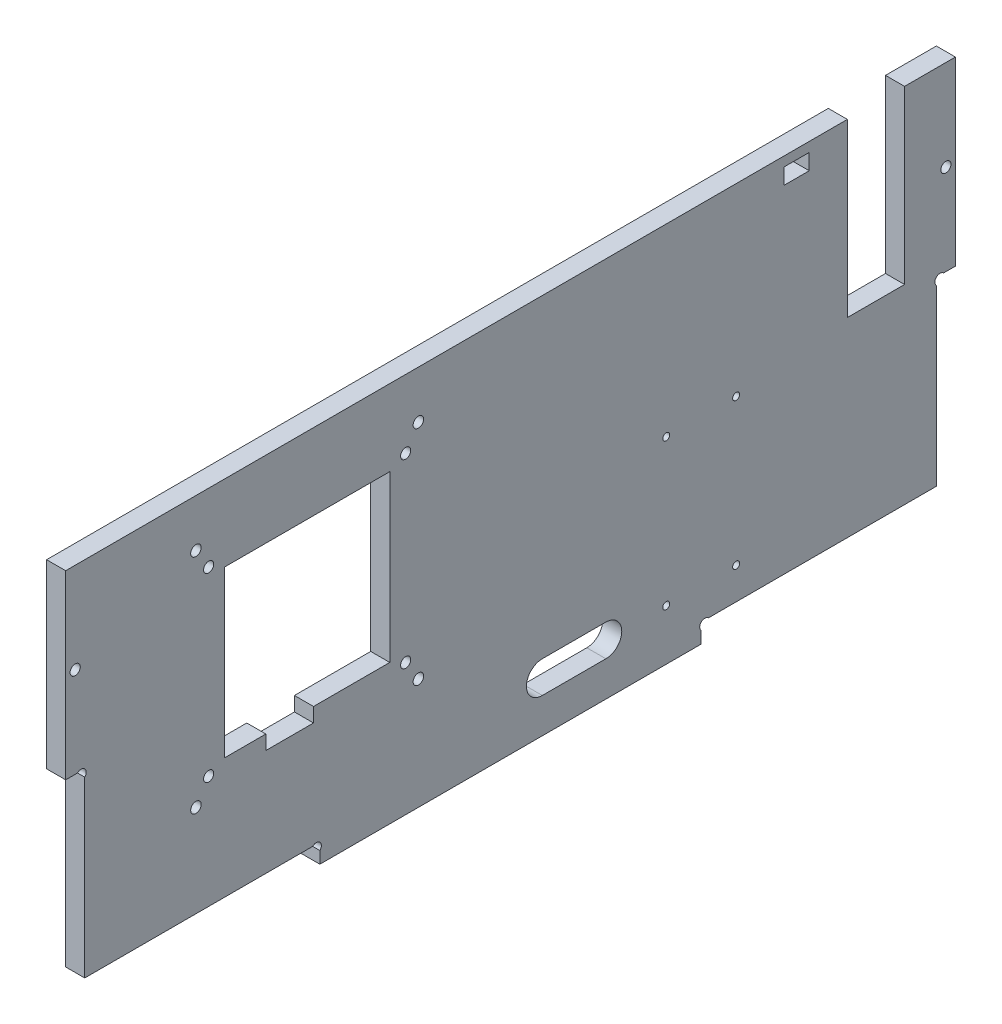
ISO-10303-21;
HEADER;
FILE_DESCRIPTION(('STEP AP214'),'2;1');
FILE_NAME('part.step','',(''),(''),'','','');
FILE_SCHEMA(('AUTOMOTIVE_DESIGN { 1 0 10303 214 1 1 1 1 }'));
ENDSEC;
DATA;
#1=APPLICATION_CONTEXT('core data for automotive mechanical design processes');
#2=APPLICATION_PROTOCOL_DEFINITION('international standard','automotive_design',2000,#1);
#3=PRODUCT_CONTEXT('',#1,'mechanical');
#4=PRODUCT('Part','Part','',(#3));
#5=PRODUCT_RELATED_PRODUCT_CATEGORY('part','',(#4));
#6=PRODUCT_DEFINITION_FORMATION('','',#4);
#7=PRODUCT_DEFINITION_CONTEXT('part definition',#1,'design');
#8=PRODUCT_DEFINITION('design','',#6,#7);
#9=PRODUCT_DEFINITION_SHAPE('','',#8);
#10=(LENGTH_UNIT() NAMED_UNIT(*) SI_UNIT(.MILLI.,.METRE.));
#11=(NAMED_UNIT(*) PLANE_ANGLE_UNIT() SI_UNIT($,.RADIAN.));
#12=(NAMED_UNIT(*) SI_UNIT($,.STERADIAN.) SOLID_ANGLE_UNIT());
#13=UNCERTAINTY_MEASURE_WITH_UNIT(LENGTH_MEASURE(1.E-05),#10,'distance_accuracy_value','');
#14=(GEOMETRIC_REPRESENTATION_CONTEXT(3) GLOBAL_UNCERTAINTY_ASSIGNED_CONTEXT((#13)) GLOBAL_UNIT_ASSIGNED_CONTEXT((#10,
#11,#12)) REPRESENTATION_CONTEXT('',''));
#15=CARTESIAN_POINT('',(0.,0.,0.));
#16=DIRECTION('',(0.,0.,1.));
#17=DIRECTION('',(1.,0.,0.));
#18=AXIS2_PLACEMENT_3D('',#15,#16,#17);
#19=CARTESIAN_POINT('',(6.,4.8686291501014,-61.1313708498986));
#20=DIRECTION('',(1.,0.,0.));
#21=DIRECTION('',(0.,0.,-1.));
#22=AXIS2_PLACEMENT_3D('',#19,#20,#21);
#23=PLANE('',#22);
#24=DIRECTION('',(0.,0.,1.));
#25=VECTOR('',#24,1.);
#26=CARTESIAN_POINT('',(6.,21.,-30.));
#27=LINE('',#26,#25);
#28=CARTESIAN_POINT('',(6.,21.,-30.));
#29=VERTEX_POINT('',#28);
#30=CARTESIAN_POINT('',(6.,21.,-10.));
#31=VERTEX_POINT('',#30);
#32=EDGE_CURVE('E310',#29,#31,#27,.T.);
#33=ORIENTED_EDGE('',*,*,#32,.F.);
#34=CARTESIAN_POINT('',(6.,16.,-30.));
#35=DIRECTION('',(1.,0.,0.));
#36=DIRECTION('',(0.,0.,-1.));
#37=AXIS2_PLACEMENT_3D('',#34,#35,#36);
#38=CIRCLE('',#37,5.);
#39=CARTESIAN_POINT('',(6.,11.,-30.));
#40=VERTEX_POINT('',#39);
#41=EDGE_CURVE('E308',#40,#29,#38,.T.);
#42=ORIENTED_EDGE('',*,*,#41,.F.);
#43=DIRECTION('',(0.,0.,-1.));
#44=VECTOR('',#43,1.);
#45=CARTESIAN_POINT('',(6.,11.,-10.));
#46=LINE('',#45,#44);
#47=CARTESIAN_POINT('',(6.,11.,-10.));
#48=VERTEX_POINT('',#47);
#49=EDGE_CURVE('E316',#48,#40,#46,.T.);
#50=ORIENTED_EDGE('',*,*,#49,.F.);
#51=CARTESIAN_POINT('',(6.,16.,-10.));
#52=DIRECTION('',(1.,0.,0.));
#53=DIRECTION('',(0.,0.,-1.));
#54=AXIS2_PLACEMENT_3D('',#51,#52,#53);
#55=CIRCLE('',#54,5.);
#56=EDGE_CURVE('E313',#31,#48,#55,.T.);
#57=ORIENTED_EDGE('',*,*,#56,.F.);
#58=EDGE_LOOP('',(#33,#42,#50,#57));
#59=FACE_BOUND('',#58,.T.);
#60=CARTESIAN_POINT('',(6.,16.,-71.));
#61=DIRECTION('',(1.,0.,0.));
#62=DIRECTION('',(0.,0.,1.));
#63=AXIS2_PLACEMENT_3D('',#60,#61,#62);
#64=CIRCLE('',#63,1.10000000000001);
#65=CARTESIAN_POINT('',(6.,16.,-69.9));
#66=VERTEX_POINT('',#65);
#67=EDGE_CURVE('E345',#66,#66,#64,.T.);
#68=ORIENTED_EDGE('',*,*,#67,.F.);
#69=EDGE_LOOP('',(#68));
#70=FACE_BOUND('',#69,.T.);
#71=CARTESIAN_POINT('',(6.,62.,-49.));
#72=DIRECTION('',(1.,0.,0.));
#73=DIRECTION('',(0.,0.,-1.));
#74=AXIS2_PLACEMENT_3D('',#71,#72,#73);
#75=CIRCLE('',#74,1.1);
#76=CARTESIAN_POINT('',(6.,62.,-50.1));
#77=VERTEX_POINT('',#76);
#78=EDGE_CURVE('E357',#77,#77,#75,.T.);
#79=ORIENTED_EDGE('',*,*,#78,.F.);
#80=EDGE_LOOP('',(#79));
#81=FACE_BOUND('',#80,.T.);
#82=CARTESIAN_POINT('',(6.,98.5,33.));
#83=DIRECTION('',(1.,0.,0.));
#84=DIRECTION('',(0.,0.,1.));
#85=AXIS2_PLACEMENT_3D('',#82,#83,#84);
#86=CIRCLE('',#85,1.60000000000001);
#87=CARTESIAN_POINT('',(6.,98.5,34.6));
#88=VERTEX_POINT('',#87);
#89=EDGE_CURVE('E369',#88,#88,#86,.T.);
#90=ORIENTED_EDGE('',*,*,#89,.F.);
#91=EDGE_LOOP('',(#90));
#92=FACE_BOUND('',#91,.T.);
#93=CARTESIAN_POINT('',(6.,41.5,33.));
#94=DIRECTION('',(1.,0.,0.));
#95=DIRECTION('',(0.,0.,-1.));
#96=AXIS2_PLACEMENT_3D('',#93,#94,#95);
#97=CIRCLE('',#96,1.60000000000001);
#98=CARTESIAN_POINT('',(6.,41.5,31.4));
#99=VERTEX_POINT('',#98);
#100=EDGE_CURVE('E381',#99,#99,#97,.T.);
#101=ORIENTED_EDGE('',*,*,#100,.F.);
#102=EDGE_LOOP('',(#101));
#103=FACE_BOUND('',#102,.T.);
#104=CARTESIAN_POINT('',(6.,35.,99.));
#105=DIRECTION('',(1.,0.,0.));
#106=DIRECTION('',(0.,0.,-1.));
#107=AXIS2_PLACEMENT_3D('',#104,#105,#106);
#108=CIRCLE('',#107,1.65);
#109=CARTESIAN_POINT('',(6.,35.,97.35));
#110=VERTEX_POINT('',#109);
#111=EDGE_CURVE('E446',#110,#110,#108,.T.);
#112=ORIENTED_EDGE('',*,*,#111,.F.);
#113=EDGE_LOOP('',(#112));
#114=FACE_BOUND('',#113,.T.);
#115=CARTESIAN_POINT('',(6.,105.,29.));
#116=DIRECTION('',(1.,0.,0.));
#117=DIRECTION('',(0.,0.,-1.));
#118=AXIS2_PLACEMENT_3D('',#115,#116,#117);
#119=CIRCLE('',#118,1.65);
#120=CARTESIAN_POINT('',(6.,105.,27.35));
#121=VERTEX_POINT('',#120);
#122=EDGE_CURVE('E458',#121,#121,#119,.T.);
#123=ORIENTED_EDGE('',*,*,#122,.F.);
#124=EDGE_LOOP('',(#123));
#125=FACE_BOUND('',#124,.T.);
#126=CARTESIAN_POINT('',(6.,91.5,-137.));
#127=DIRECTION('',(1.,0.,0.));
#128=DIRECTION('',(0.,0.,-1.));
#129=AXIS2_PLACEMENT_3D('',#126,#127,#128);
#130=CIRCLE('',#129,1.59999999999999);
#131=CARTESIAN_POINT('',(6.,91.5,-138.6));
#132=VERTEX_POINT('',#131);
#133=EDGE_CURVE('E470',#132,#132,#130,.T.);
#134=ORIENTED_EDGE('',*,*,#133,.F.);
#135=EDGE_LOOP('',(#134));
#136=FACE_BOUND('',#135,.T.);
#137=CARTESIAN_POINT('',(6.,4.8686291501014,-61.1313708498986));
#138=DIRECTION('',(-1.,0.,0.));
#139=DIRECTION('',(0.,0.,-1.));
#140=AXIS2_PLACEMENT_3D('',#137,#138,#139);
#141=CIRCLE('',#140,1.60000000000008);
#142=CARTESIAN_POINT('',(6.,3.7372583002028,-60.));
#143=VERTEX_POINT('',#142);
#144=CARTESIAN_POINT('',(6.,5.99999999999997,-62.262741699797));
#145=VERTEX_POINT('',#144);
#146=EDGE_CURVE('E482',#143,#145,#141,.T.);
#147=ORIENTED_EDGE('',*,*,#146,.T.);
#148=DIRECTION('',(0.,0.,-1.));
#149=VECTOR('',#148,1.);
#150=CARTESIAN_POINT('',(6.,5.99999999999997,-62.262741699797));
#151=LINE('',#150,#149);
#152=CARTESIAN_POINT('',(6.,6.,-134.));
#153=VERTEX_POINT('',#152);
#154=EDGE_CURVE('E485',#145,#153,#151,.T.);
#155=ORIENTED_EDGE('',*,*,#154,.T.);
#156=DIRECTION('',(0.,1.,0.));
#157=VECTOR('',#156,1.);
#158=CARTESIAN_POINT('',(6.,6.,-134.));
#159=LINE('',#158,#157);
#160=CARTESIAN_POINT('',(6.,60.7372583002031,-134.));
#161=VERTEX_POINT('',#160);
#162=EDGE_CURVE('E488',#153,#161,#159,.T.);
#163=ORIENTED_EDGE('',*,*,#162,.T.);
#164=CARTESIAN_POINT('',(6.,61.8686291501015,-135.131370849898));
#165=DIRECTION('',(-1.,0.,0.));
#166=DIRECTION('',(0.,0.,-1.));
#167=AXIS2_PLACEMENT_3D('',#164,#165,#166);
#168=CIRCLE('',#167,1.6);
#169=CARTESIAN_POINT('',(6.,63.,-136.262741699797));
#170=VERTEX_POINT('',#169);
#171=EDGE_CURVE('E490',#161,#170,#168,.T.);
#172=ORIENTED_EDGE('',*,*,#171,.T.);
#173=DIRECTION('',(0.,0.,-1.));
#174=VECTOR('',#173,1.);
#175=CARTESIAN_POINT('',(6.,63.,-136.262741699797));
#176=LINE('',#175,#174);
#177=CARTESIAN_POINT('',(6.,63.,-140.));
#178=VERTEX_POINT('',#177);
#179=EDGE_CURVE('E492',#170,#178,#176,.T.);
#180=ORIENTED_EDGE('',*,*,#179,.T.);
#181=DIRECTION('',(0.,1.,0.));
#182=VECTOR('',#181,1.);
#183=CARTESIAN_POINT('',(6.,63.,-140.));
#184=LINE('',#183,#182);
#185=CARTESIAN_POINT('',(6.,120.,-140.));
#186=VERTEX_POINT('',#185);
#187=EDGE_CURVE('E494',#178,#186,#184,.T.);
#188=ORIENTED_EDGE('',*,*,#187,.T.);
#189=DIRECTION('',(0.,0.,1.));
#190=VECTOR('',#189,1.);
#191=CARTESIAN_POINT('',(6.,120.,-124.));
#192=LINE('',#191,#190);
#193=CARTESIAN_POINT('',(6.,120.,-124.));
#194=VERTEX_POINT('',#193);
#195=EDGE_CURVE('E496',#186,#194,#192,.T.);
#196=ORIENTED_EDGE('',*,*,#195,.T.);
#197=DIRECTION('',(0.,-1.,0.));
#198=VECTOR('',#197,1.);
#199=CARTESIAN_POINT('',(6.,66.,-124.));
#200=LINE('',#199,#198);
#201=CARTESIAN_POINT('',(6.,66.,-124.));
#202=VERTEX_POINT('',#201);
#203=EDGE_CURVE('E498',#194,#202,#200,.T.);
#204=ORIENTED_EDGE('',*,*,#203,.T.);
#205=DIRECTION('',(0.,0.,1.));
#206=VECTOR('',#205,1.);
#207=CARTESIAN_POINT('',(6.,66.,-106.));
#208=LINE('',#207,#206);
#209=CARTESIAN_POINT('',(6.,66.,-106.));
#210=VERTEX_POINT('',#209);
#211=EDGE_CURVE('E500',#202,#210,#208,.T.);
#212=ORIENTED_EDGE('',*,*,#211,.T.);
#213=DIRECTION('',(0.,1.,0.));
#214=VECTOR('',#213,1.);
#215=CARTESIAN_POINT('',(6.,120.,-106.));
#216=LINE('',#215,#214);
#217=CARTESIAN_POINT('',(6.,120.,-106.));
#218=VERTEX_POINT('',#217);
#219=EDGE_CURVE('E502',#210,#218,#216,.T.);
#220=ORIENTED_EDGE('',*,*,#219,.T.);
#221=DIRECTION('',(0.,0.,1.));
#222=VECTOR('',#221,1.);
#223=CARTESIAN_POINT('',(6.,120.,140.));
#224=LINE('',#223,#222);
#225=CARTESIAN_POINT('',(6.,120.,140.));
#226=VERTEX_POINT('',#225);
#227=EDGE_CURVE('E504',#218,#226,#224,.T.);
#228=ORIENTED_EDGE('',*,*,#227,.T.);
#229=DIRECTION('',(0.,-1.,0.));
#230=VECTOR('',#229,1.);
#231=CARTESIAN_POINT('',(6.,63.,140.));
#232=LINE('',#231,#230);
#233=CARTESIAN_POINT('',(6.,63.,140.));
#234=VERTEX_POINT('',#233);
#235=EDGE_CURVE('E506',#226,#234,#232,.T.);
#236=ORIENTED_EDGE('',*,*,#235,.T.);
#237=DIRECTION('',(0.,0.,-1.));
#238=VECTOR('',#237,1.);
#239=CARTESIAN_POINT('',(6.,63.,136.262741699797));
#240=LINE('',#239,#238);
#241=CARTESIAN_POINT('',(6.,63.,136.262741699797));
#242=VERTEX_POINT('',#241);
#243=EDGE_CURVE('E508',#234,#242,#240,.T.);
#244=ORIENTED_EDGE('',*,*,#243,.T.);
#245=CARTESIAN_POINT('',(6.,61.8686291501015,135.131370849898));
#246=DIRECTION('',(-1.,0.,0.));
#247=DIRECTION('',(0.,0.,1.));
#248=AXIS2_PLACEMENT_3D('',#245,#246,#247);
#249=CIRCLE('',#248,1.6);
#250=CARTESIAN_POINT('',(6.,60.7372583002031,134.));
#251=VERTEX_POINT('',#250);
#252=EDGE_CURVE('E510',#242,#251,#249,.T.);
#253=ORIENTED_EDGE('',*,*,#252,.T.);
#254=DIRECTION('',(0.,-1.,0.));
#255=VECTOR('',#254,1.);
#256=CARTESIAN_POINT('',(6.,6.,134.));
#257=LINE('',#256,#255);
#258=CARTESIAN_POINT('',(6.,6.,134.));
#259=VERTEX_POINT('',#258);
#260=EDGE_CURVE('E512',#251,#259,#257,.T.);
#261=ORIENTED_EDGE('',*,*,#260,.T.);
#262=DIRECTION('',(0.,0.,-1.));
#263=VECTOR('',#262,1.);
#264=CARTESIAN_POINT('',(6.,5.99999999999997,62.262741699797));
#265=LINE('',#264,#263);
#266=CARTESIAN_POINT('',(6.,5.99999999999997,62.262741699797));
#267=VERTEX_POINT('',#266);
#268=EDGE_CURVE('E514',#259,#267,#265,.T.);
#269=ORIENTED_EDGE('',*,*,#268,.T.);
#270=CARTESIAN_POINT('',(6.,4.86862915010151,61.1313708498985));
#271=DIRECTION('',(-1.,0.,0.));
#272=DIRECTION('',(0.,0.,1.));
#273=AXIS2_PLACEMENT_3D('',#270,#271,#272);
#274=CIRCLE('',#273,1.6);
#275=CARTESIAN_POINT('',(6.,3.73725830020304,60.));
#276=VERTEX_POINT('',#275);
#277=EDGE_CURVE('E516',#267,#276,#274,.T.);
#278=ORIENTED_EDGE('',*,*,#277,.T.);
#279=DIRECTION('',(0.,-1.,0.));
#280=VECTOR('',#279,1.);
#281=CARTESIAN_POINT('',(6.,3.73725830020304,60.));
#282=LINE('',#281,#280);
#283=CARTESIAN_POINT('',(6.,0.,60.));
#284=VERTEX_POINT('',#283);
#285=EDGE_CURVE('E518',#276,#284,#282,.T.);
#286=ORIENTED_EDGE('',*,*,#285,.T.);
#287=DIRECTION('',(0.,0.,-1.));
#288=VECTOR('',#287,1.);
#289=CARTESIAN_POINT('',(6.,0.,60.));
#290=LINE('',#289,#288);
#291=CARTESIAN_POINT('',(6.,0.,-60.));
#292=VERTEX_POINT('',#291);
#293=EDGE_CURVE('E520',#284,#292,#290,.T.);
#294=ORIENTED_EDGE('',*,*,#293,.T.);
#295=DIRECTION('',(0.,1.,0.));
#296=VECTOR('',#295,1.);
#297=CARTESIAN_POINT('',(6.,0.,-60.));
#298=LINE('',#297,#296);
#299=EDGE_CURVE('E522',#292,#143,#298,.T.);
#300=ORIENTED_EDGE('',*,*,#299,.T.);
#301=EDGE_LOOP('',(#147,#155,#163,#172,#180,#188,#196,#204,#212,#220,#228,#236,#244,#253,#261,
#269,#278,#286,#294,#300));
#302=FACE_BOUND('',#301,.T.);
#303=CARTESIAN_POINT('',(6.,91.5,137.));
#304=DIRECTION('',(1.,0.,0.));
#305=DIRECTION('',(0.,0.,1.));
#306=AXIS2_PLACEMENT_3D('',#303,#304,#305);
#307=CIRCLE('',#306,1.59999999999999);
#308=CARTESIAN_POINT('',(6.,91.5,138.6));
#309=VERTEX_POINT('',#308);
#310=EDGE_CURVE('E476',#309,#309,#307,.T.);
#311=ORIENTED_EDGE('',*,*,#310,.F.);
#312=EDGE_LOOP('',(#311));
#313=FACE_BOUND('',#312,.T.);
#314=CARTESIAN_POINT('',(6.,105.,99.));
#315=DIRECTION('',(1.,0.,0.));
#316=DIRECTION('',(0.,0.,1.));
#317=AXIS2_PLACEMENT_3D('',#314,#315,#316);
#318=CIRCLE('',#317,1.65);
#319=CARTESIAN_POINT('',(6.,105.,100.65));
#320=VERTEX_POINT('',#319);
#321=EDGE_CURVE('E464',#320,#320,#318,.T.);
#322=ORIENTED_EDGE('',*,*,#321,.F.);
#323=EDGE_LOOP('',(#322));
#324=FACE_BOUND('',#323,.T.);
#325=CARTESIAN_POINT('',(6.,35.,29.));
#326=DIRECTION('',(1.,0.,0.));
#327=DIRECTION('',(0.,0.,1.));
#328=AXIS2_PLACEMENT_3D('',#325,#326,#327);
#329=CIRCLE('',#328,1.65);
#330=CARTESIAN_POINT('',(6.,35.,30.65));
#331=VERTEX_POINT('',#330);
#332=EDGE_CURVE('E452',#331,#331,#329,.T.);
#333=ORIENTED_EDGE('',*,*,#332,.F.);
#334=EDGE_LOOP('',(#333));
#335=FACE_BOUND('',#334,.T.);
#336=DIRECTION('',(0.,-1.,0.));
#337=VECTOR('',#336,1.);
#338=CARTESIAN_POINT('',(6.,44.,77.));
#339=LINE('',#338,#337);
#340=CARTESIAN_POINT('',(6.,44.,77.));
#341=VERTEX_POINT('',#340);
#342=CARTESIAN_POINT('',(6.,39.5,77.));
#343=VERTEX_POINT('',#342);
#344=EDGE_CURVE('E389',#341,#343,#339,.T.);
#345=ORIENTED_EDGE('',*,*,#344,.F.);
#346=DIRECTION('',(0.,0.,-1.));
#347=VECTOR('',#346,1.);
#348=CARTESIAN_POINT('',(6.,44.,77.));
#349=LINE('',#348,#347);
#350=CARTESIAN_POINT('',(6.,44.,90.));
#351=VERTEX_POINT('',#350);
#352=EDGE_CURVE('E387',#351,#341,#349,.T.);
#353=ORIENTED_EDGE('',*,*,#352,.F.);
#354=DIRECTION('',(0.,-1.,0.));
#355=VECTOR('',#354,1.);
#356=CARTESIAN_POINT('',(6.,96.,90.0000000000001));
#357=LINE('',#356,#355);
#358=CARTESIAN_POINT('',(6.,96.,90.0000000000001));
#359=VERTEX_POINT('',#358);
#360=EDGE_CURVE('E403',#359,#351,#357,.T.);
#361=ORIENTED_EDGE('',*,*,#360,.F.);
#362=DIRECTION('',(0.,0.,1.));
#363=VECTOR('',#362,1.);
#364=CARTESIAN_POINT('',(6.,96.,38.0000000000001));
#365=LINE('',#364,#363);
#366=CARTESIAN_POINT('',(6.,96.,38.0000000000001));
#367=VERTEX_POINT('',#366);
#368=EDGE_CURVE('E400',#367,#359,#365,.T.);
#369=ORIENTED_EDGE('',*,*,#368,.F.);
#370=DIRECTION('',(0.,1.,0.));
#371=VECTOR('',#370,1.);
#372=CARTESIAN_POINT('',(6.,96.,38.0000000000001));
#373=LINE('',#372,#371);
#374=CARTESIAN_POINT('',(6.,44.,38.0000000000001));
#375=VERTEX_POINT('',#374);
#376=EDGE_CURVE('E398',#375,#367,#373,.T.);
#377=ORIENTED_EDGE('',*,*,#376,.F.);
#378=DIRECTION('',(0.,0.,-1.));
#379=VECTOR('',#378,1.);
#380=CARTESIAN_POINT('',(6.,44.,38.0000000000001));
#381=LINE('',#380,#379);
#382=CARTESIAN_POINT('',(6.,44.,62.));
#383=VERTEX_POINT('',#382);
#384=EDGE_CURVE('E396',#383,#375,#381,.T.);
#385=ORIENTED_EDGE('',*,*,#384,.F.);
#386=DIRECTION('',(0.,1.,0.));
#387=VECTOR('',#386,1.);
#388=CARTESIAN_POINT('',(6.,44.,62.));
#389=LINE('',#388,#387);
#390=CARTESIAN_POINT('',(6.,39.5,62.));
#391=VERTEX_POINT('',#390);
#392=EDGE_CURVE('E394',#391,#383,#389,.T.);
#393=ORIENTED_EDGE('',*,*,#392,.F.);
#394=DIRECTION('',(0.,0.,-1.));
#395=VECTOR('',#394,1.);
#396=CARTESIAN_POINT('',(6.,39.5,62.));
#397=LINE('',#396,#395);
#398=EDGE_CURVE('E392',#343,#391,#397,.T.);
#399=ORIENTED_EDGE('',*,*,#398,.F.);
#400=EDGE_LOOP('',(#345,#353,#361,#369,#377,#385,#393,#399));
#401=FACE_BOUND('',#400,.T.);
#402=CARTESIAN_POINT('',(6.,98.5,95.));
#403=DIRECTION('',(1.,0.,0.));
#404=DIRECTION('',(0.,0.,-1.));
#405=AXIS2_PLACEMENT_3D('',#402,#403,#404);
#406=CIRCLE('',#405,1.60000000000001);
#407=CARTESIAN_POINT('',(6.,98.5,93.4));
#408=VERTEX_POINT('',#407);
#409=EDGE_CURVE('E375',#408,#408,#406,.T.);
#410=ORIENTED_EDGE('',*,*,#409,.F.);
#411=EDGE_LOOP('',(#410));
#412=FACE_BOUND('',#411,.T.);
#413=CARTESIAN_POINT('',(6.,41.5,95.));
#414=DIRECTION('',(1.,0.,0.));
#415=DIRECTION('',(0.,0.,1.));
#416=AXIS2_PLACEMENT_3D('',#413,#414,#415);
#417=CIRCLE('',#416,1.60000000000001);
#418=CARTESIAN_POINT('',(6.,41.5,96.6));
#419=VERTEX_POINT('',#418);
#420=EDGE_CURVE('E363',#419,#419,#417,.T.);
#421=ORIENTED_EDGE('',*,*,#420,.F.);
#422=EDGE_LOOP('',(#421));
#423=FACE_BOUND('',#422,.T.);
#424=CARTESIAN_POINT('',(6.,16.,-49.));
#425=DIRECTION('',(1.,0.,0.));
#426=DIRECTION('',(0.,0.,-1.));
#427=AXIS2_PLACEMENT_3D('',#424,#425,#426);
#428=CIRCLE('',#427,1.1);
#429=CARTESIAN_POINT('',(6.,16.,-50.1));
#430=VERTEX_POINT('',#429);
#431=EDGE_CURVE('E351',#430,#430,#428,.T.);
#432=ORIENTED_EDGE('',*,*,#431,.F.);
#433=EDGE_LOOP('',(#432));
#434=FACE_BOUND('',#433,.T.);
#435=CARTESIAN_POINT('',(6.,62.,-71.));
#436=DIRECTION('',(1.,0.,0.));
#437=DIRECTION('',(0.,0.,1.));
#438=AXIS2_PLACEMENT_3D('',#435,#436,#437);
#439=CIRCLE('',#438,1.10000000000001);
#440=CARTESIAN_POINT('',(6.,62.,-69.9));
#441=VERTEX_POINT('',#440);
#442=EDGE_CURVE('E339',#441,#441,#439,.T.);
#443=ORIENTED_EDGE('',*,*,#442,.F.);
#444=EDGE_LOOP('',(#443));
#445=FACE_BOUND('',#444,.T.);
#446=DIRECTION('',(0.,0.,-1.));
#447=VECTOR('',#446,1.);
#448=CARTESIAN_POINT('',(6.,112.,-94.));
#449=LINE('',#448,#447);
#450=CARTESIAN_POINT('',(6.,112.,-86.));
#451=VERTEX_POINT('',#450);
#452=CARTESIAN_POINT('',(6.,112.,-94.));
#453=VERTEX_POINT('',#452);
#454=EDGE_CURVE('E278',#451,#453,#449,.T.);
#455=ORIENTED_EDGE('',*,*,#454,.F.);
#456=DIRECTION('',(0.,-1.,0.));
#457=VECTOR('',#456,1.);
#458=CARTESIAN_POINT('',(6.,117.,-86.));
#459=LINE('',#458,#457);
#460=CARTESIAN_POINT('',(6.,117.,-86.));
#461=VERTEX_POINT('',#460);
#462=EDGE_CURVE('E270',#461,#451,#459,.T.);
#463=ORIENTED_EDGE('',*,*,#462,.F.);
#464=DIRECTION('',(0.,0.,1.));
#465=VECTOR('',#464,1.);
#466=CARTESIAN_POINT('',(6.,117.,-94.));
#467=LINE('',#466,#465);
#468=CARTESIAN_POINT('',(6.,117.,-94.));
#469=VERTEX_POINT('',#468);
#470=EDGE_CURVE('E292',#469,#461,#467,.T.);
#471=ORIENTED_EDGE('',*,*,#470,.F.);
#472=DIRECTION('',(0.,1.,0.));
#473=VECTOR('',#472,1.);
#474=CARTESIAN_POINT('',(6.,117.,-94.));
#475=LINE('',#474,#473);
#476=EDGE_CURVE('E290',#453,#469,#475,.T.);
#477=ORIENTED_EDGE('',*,*,#476,.F.);
#478=EDGE_LOOP('',(#455,#463,#471,#477));
#479=FACE_BOUND('',#478,.T.);
#480=ADVANCED_FACE('F37',(#59,#70,#81,#92,#103,#114,#125,#136,#302,#313,#324,#335,#401,#412,
#423,#434,#445,#479),#23,.T.);
#481=CARTESIAN_POINT('',(0.,4.8686291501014,-61.1313708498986));
#482=DIRECTION('',(1.,0.,0.));
#483=DIRECTION('',(0.,0.,-1.));
#484=AXIS2_PLACEMENT_3D('',#481,#482,#483);
#485=PLANE('',#484);
#486=CARTESIAN_POINT('',(0.,53.,-36.));
#487=DIRECTION('',(-1.,0.,0.));
#488=DIRECTION('',(0.,0.,-1.));
#489=AXIS2_PLACEMENT_3D('',#486,#487,#488);
#490=CIRCLE('',#489,1.10000000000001);
#491=CARTESIAN_POINT('',(0.,53.,-37.1));
#492=VERTEX_POINT('',#491);
#493=EDGE_CURVE('E1276',#492,#492,#490,.T.);
#494=ORIENTED_EDGE('',*,*,#493,.F.);
#495=EDGE_LOOP('',(#494));
#496=FACE_BOUND('',#495,.T.);
#497=CARTESIAN_POINT('',(0.,53.,10.));
#498=DIRECTION('',(-1.,0.,0.));
#499=DIRECTION('',(0.,0.,1.));
#500=AXIS2_PLACEMENT_3D('',#497,#498,#499);
#501=CIRCLE('',#500,1.1);
#502=CARTESIAN_POINT('',(0.,53.,11.1));
#503=VERTEX_POINT('',#502);
#504=EDGE_CURVE('E1275',#503,#503,#501,.T.);
#505=ORIENTED_EDGE('',*,*,#504,.F.);
#506=EDGE_LOOP('',(#505));
#507=FACE_BOUND('',#506,.T.);
#508=CARTESIAN_POINT('',(0.,75.,10.));
#509=DIRECTION('',(-1.,0.,0.));
#510=DIRECTION('',(0.,0.,-1.));
#511=AXIS2_PLACEMENT_3D('',#508,#509,#510);
#512=CIRCLE('',#511,1.1);
#513=CARTESIAN_POINT('',(0.,75.,8.90000000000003));
#514=VERTEX_POINT('',#513);
#515=EDGE_CURVE('E1285',#514,#514,#512,.T.);
#516=ORIENTED_EDGE('',*,*,#515,.F.);
#517=EDGE_LOOP('',(#516));
#518=FACE_BOUND('',#517,.T.);
#519=CARTESIAN_POINT('',(0.,75.,-36.));
#520=DIRECTION('',(-1.,0.,0.));
#521=DIRECTION('',(0.,0.,1.));
#522=AXIS2_PLACEMENT_3D('',#519,#520,#521);
#523=CIRCLE('',#522,1.1);
#524=CARTESIAN_POINT('',(0.,75.,-34.9));
#525=VERTEX_POINT('',#524);
#526=EDGE_CURVE('E1290',#525,#525,#523,.T.);
#527=ORIENTED_EDGE('',*,*,#526,.F.);
#528=EDGE_LOOP('',(#527));
#529=FACE_BOUND('',#528,.T.);
#530=CARTESIAN_POINT('',(0.,16.,-30.));
#531=DIRECTION('',(1.,0.,0.));
#532=DIRECTION('',(0.,0.,-1.));
#533=AXIS2_PLACEMENT_3D('',#530,#531,#532);
#534=CIRCLE('',#533,5.);
#535=CARTESIAN_POINT('',(0.,11.,-30.));
#536=VERTEX_POINT('',#535);
#537=CARTESIAN_POINT('',(0.,21.,-30.));
#538=VERTEX_POINT('',#537);
#539=EDGE_CURVE('E286',#536,#538,#534,.T.);
#540=ORIENTED_EDGE('',*,*,#539,.T.);
#541=DIRECTION('',(0.,0.,1.));
#542=VECTOR('',#541,1.);
#543=CARTESIAN_POINT('',(0.,21.,-30.));
#544=LINE('',#543,#542);
#545=CARTESIAN_POINT('',(0.,21.,-10.));
#546=VERTEX_POINT('',#545);
#547=EDGE_CURVE('E321',#538,#546,#544,.T.);
#548=ORIENTED_EDGE('',*,*,#547,.T.);
#549=CARTESIAN_POINT('',(0.,16.,-10.));
#550=DIRECTION('',(1.,0.,0.));
#551=DIRECTION('',(0.,0.,-1.));
#552=AXIS2_PLACEMENT_3D('',#549,#550,#551);
#553=CIRCLE('',#552,5.);
#554=CARTESIAN_POINT('',(0.,11.,-10.));
#555=VERTEX_POINT('',#554);
#556=EDGE_CURVE('E324',#546,#555,#553,.T.);
#557=ORIENTED_EDGE('',*,*,#556,.T.);
#558=DIRECTION('',(0.,0.,-1.));
#559=VECTOR('',#558,1.);
#560=CARTESIAN_POINT('',(0.,11.,-10.));
#561=LINE('',#560,#559);
#562=EDGE_CURVE('E311',#555,#536,#561,.T.);
#563=ORIENTED_EDGE('',*,*,#562,.T.);
#564=EDGE_LOOP('',(#540,#548,#557,#563));
#565=FACE_BOUND('',#564,.T.);
#566=CARTESIAN_POINT('',(0.,16.,-71.));
#567=DIRECTION('',(1.,0.,0.));
#568=DIRECTION('',(0.,0.,1.));
#569=AXIS2_PLACEMENT_3D('',#566,#567,#568);
#570=CIRCLE('',#569,1.10000000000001);
#571=CARTESIAN_POINT('',(0.,16.,-69.9));
#572=VERTEX_POINT('',#571);
#573=EDGE_CURVE('E342',#572,#572,#570,.T.);
#574=ORIENTED_EDGE('',*,*,#573,.T.);
#575=EDGE_LOOP('',(#574));
#576=FACE_BOUND('',#575,.T.);
#577=CARTESIAN_POINT('',(0.,62.,-49.));
#578=DIRECTION('',(1.,0.,0.));
#579=DIRECTION('',(0.,0.,-1.));
#580=AXIS2_PLACEMENT_3D('',#577,#578,#579);
#581=CIRCLE('',#580,1.1);
#582=CARTESIAN_POINT('',(0.,62.,-50.1));
#583=VERTEX_POINT('',#582);
#584=EDGE_CURVE('E354',#583,#583,#581,.T.);
#585=ORIENTED_EDGE('',*,*,#584,.T.);
#586=EDGE_LOOP('',(#585));
#587=FACE_BOUND('',#586,.T.);
#588=CARTESIAN_POINT('',(0.,98.5,33.));
#589=DIRECTION('',(1.,0.,0.));
#590=DIRECTION('',(0.,0.,1.));
#591=AXIS2_PLACEMENT_3D('',#588,#589,#590);
#592=CIRCLE('',#591,1.60000000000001);
#593=CARTESIAN_POINT('',(0.,98.5,34.6));
#594=VERTEX_POINT('',#593);
#595=EDGE_CURVE('E366',#594,#594,#592,.T.);
#596=ORIENTED_EDGE('',*,*,#595,.T.);
#597=EDGE_LOOP('',(#596));
#598=FACE_BOUND('',#597,.T.);
#599=CARTESIAN_POINT('',(0.,41.5,33.));
#600=DIRECTION('',(1.,0.,0.));
#601=DIRECTION('',(0.,0.,-1.));
#602=AXIS2_PLACEMENT_3D('',#599,#600,#601);
#603=CIRCLE('',#602,1.60000000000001);
#604=CARTESIAN_POINT('',(0.,41.5,31.4));
#605=VERTEX_POINT('',#604);
#606=EDGE_CURVE('E378',#605,#605,#603,.T.);
#607=ORIENTED_EDGE('',*,*,#606,.T.);
#608=EDGE_LOOP('',(#607));
#609=FACE_BOUND('',#608,.T.);
#610=CARTESIAN_POINT('',(0.,35.,99.));
#611=DIRECTION('',(1.,0.,0.));
#612=DIRECTION('',(0.,0.,-1.));
#613=AXIS2_PLACEMENT_3D('',#610,#611,#612);
#614=CIRCLE('',#613,1.65);
#615=CARTESIAN_POINT('',(0.,35.,97.35));
#616=VERTEX_POINT('',#615);
#617=EDGE_CURVE('E445',#616,#616,#614,.T.);
#618=ORIENTED_EDGE('',*,*,#617,.T.);
#619=EDGE_LOOP('',(#618));
#620=FACE_BOUND('',#619,.T.);
#621=CARTESIAN_POINT('',(0.,105.,29.));
#622=DIRECTION('',(1.,0.,0.));
#623=DIRECTION('',(0.,0.,-1.));
#624=AXIS2_PLACEMENT_3D('',#621,#622,#623);
#625=CIRCLE('',#624,1.65);
#626=CARTESIAN_POINT('',(0.,105.,27.35));
#627=VERTEX_POINT('',#626);
#628=EDGE_CURVE('E455',#627,#627,#625,.T.);
#629=ORIENTED_EDGE('',*,*,#628,.T.);
#630=EDGE_LOOP('',(#629));
#631=FACE_BOUND('',#630,.T.);
#632=CARTESIAN_POINT('',(0.,91.5,-137.));
#633=DIRECTION('',(1.,0.,0.));
#634=DIRECTION('',(0.,0.,-1.));
#635=AXIS2_PLACEMENT_3D('',#632,#633,#634);
#636=CIRCLE('',#635,1.59999999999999);
#637=CARTESIAN_POINT('',(0.,91.5,-138.6));
#638=VERTEX_POINT('',#637);
#639=EDGE_CURVE('E467',#638,#638,#636,.T.);
#640=ORIENTED_EDGE('',*,*,#639,.T.);
#641=EDGE_LOOP('',(#640));
#642=FACE_BOUND('',#641,.T.);
#643=CARTESIAN_POINT('',(0.,4.8686291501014,-61.1313708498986));
#644=DIRECTION('',(-1.,0.,0.));
#645=DIRECTION('',(0.,0.,-1.));
#646=AXIS2_PLACEMENT_3D('',#643,#644,#645);
#647=CIRCLE('',#646,1.60000000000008);
#648=CARTESIAN_POINT('',(0.,3.7372583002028,-60.));
#649=VERTEX_POINT('',#648);
#650=CARTESIAN_POINT('',(0.,5.99999999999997,-62.262741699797));
#651=VERTEX_POINT('',#650);
#652=EDGE_CURVE('E479',#649,#651,#647,.T.);
#653=ORIENTED_EDGE('',*,*,#652,.F.);
#654=DIRECTION('',(0.,1.,0.));
#655=VECTOR('',#654,1.);
#656=CARTESIAN_POINT('',(0.,0.,-60.));
#657=LINE('',#656,#655);
#658=CARTESIAN_POINT('',(0.,0.,-60.));
#659=VERTEX_POINT('',#658);
#660=EDGE_CURVE('E486',#659,#649,#657,.T.);
#661=ORIENTED_EDGE('',*,*,#660,.F.);
#662=DIRECTION('',(0.,0.,-1.));
#663=VECTOR('',#662,1.);
#664=CARTESIAN_POINT('',(0.,0.,60.));
#665=LINE('',#664,#663);
#666=CARTESIAN_POINT('',(0.,0.,60.));
#667=VERTEX_POINT('',#666);
#668=EDGE_CURVE('E561',#667,#659,#665,.T.);
#669=ORIENTED_EDGE('',*,*,#668,.F.);
#670=DIRECTION('',(0.,-1.,0.));
#671=VECTOR('',#670,1.);
#672=CARTESIAN_POINT('',(0.,3.73725830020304,60.));
#673=LINE('',#672,#671);
#674=CARTESIAN_POINT('',(0.,3.73725830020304,60.));
#675=VERTEX_POINT('',#674);
#676=EDGE_CURVE('E559',#675,#667,#673,.T.);
#677=ORIENTED_EDGE('',*,*,#676,.F.);
#678=CARTESIAN_POINT('',(0.,4.86862915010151,61.1313708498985));
#679=DIRECTION('',(-1.,0.,0.));
#680=DIRECTION('',(0.,0.,1.));
#681=AXIS2_PLACEMENT_3D('',#678,#679,#680);
#682=CIRCLE('',#681,1.6);
#683=CARTESIAN_POINT('',(0.,5.99999999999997,62.262741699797));
#684=VERTEX_POINT('',#683);
#685=EDGE_CURVE('E557',#684,#675,#682,.T.);
#686=ORIENTED_EDGE('',*,*,#685,.F.);
#687=DIRECTION('',(0.,0.,-1.));
#688=VECTOR('',#687,1.);
#689=CARTESIAN_POINT('',(0.,5.99999999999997,62.262741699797));
#690=LINE('',#689,#688);
#691=CARTESIAN_POINT('',(0.,6.,134.));
#692=VERTEX_POINT('',#691);
#693=EDGE_CURVE('E555',#692,#684,#690,.T.);
#694=ORIENTED_EDGE('',*,*,#693,.F.);
#695=DIRECTION('',(0.,-1.,0.));
#696=VECTOR('',#695,1.);
#697=CARTESIAN_POINT('',(0.,6.,134.));
#698=LINE('',#697,#696);
#699=CARTESIAN_POINT('',(0.,60.7372583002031,134.));
#700=VERTEX_POINT('',#699);
#701=EDGE_CURVE('E553',#700,#692,#698,.T.);
#702=ORIENTED_EDGE('',*,*,#701,.F.);
#703=CARTESIAN_POINT('',(0.,61.8686291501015,135.131370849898));
#704=DIRECTION('',(-1.,0.,0.));
#705=DIRECTION('',(0.,0.,1.));
#706=AXIS2_PLACEMENT_3D('',#703,#704,#705);
#707=CIRCLE('',#706,1.6);
#708=CARTESIAN_POINT('',(0.,63.,136.262741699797));
#709=VERTEX_POINT('',#708);
#710=EDGE_CURVE('E551',#709,#700,#707,.T.);
#711=ORIENTED_EDGE('',*,*,#710,.F.);
#712=DIRECTION('',(0.,0.,-1.));
#713=VECTOR('',#712,1.);
#714=CARTESIAN_POINT('',(0.,63.,136.262741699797));
#715=LINE('',#714,#713);
#716=CARTESIAN_POINT('',(0.,63.,140.));
#717=VERTEX_POINT('',#716);
#718=EDGE_CURVE('E549',#717,#709,#715,.T.);
#719=ORIENTED_EDGE('',*,*,#718,.F.);
#720=DIRECTION('',(0.,-1.,0.));
#721=VECTOR('',#720,1.);
#722=CARTESIAN_POINT('',(0.,63.,140.));
#723=LINE('',#722,#721);
#724=CARTESIAN_POINT('',(0.,120.,140.));
#725=VERTEX_POINT('',#724);
#726=EDGE_CURVE('E547',#725,#717,#723,.T.);
#727=ORIENTED_EDGE('',*,*,#726,.F.);
#728=DIRECTION('',(0.,0.,1.));
#729=VECTOR('',#728,1.);
#730=CARTESIAN_POINT('',(0.,120.,140.));
#731=LINE('',#730,#729);
#732=CARTESIAN_POINT('',(0.,120.,-106.));
#733=VERTEX_POINT('',#732);
#734=EDGE_CURVE('E545',#733,#725,#731,.T.);
#735=ORIENTED_EDGE('',*,*,#734,.F.);
#736=DIRECTION('',(0.,1.,0.));
#737=VECTOR('',#736,1.);
#738=CARTESIAN_POINT('',(0.,120.,-106.));
#739=LINE('',#738,#737);
#740=CARTESIAN_POINT('',(0.,66.,-106.));
#741=VERTEX_POINT('',#740);
#742=EDGE_CURVE('E543',#741,#733,#739,.T.);
#743=ORIENTED_EDGE('',*,*,#742,.F.);
#744=DIRECTION('',(0.,0.,1.));
#745=VECTOR('',#744,1.);
#746=CARTESIAN_POINT('',(0.,66.,-106.));
#747=LINE('',#746,#745);
#748=CARTESIAN_POINT('',(0.,66.,-124.));
#749=VERTEX_POINT('',#748);
#750=EDGE_CURVE('E541',#749,#741,#747,.T.);
#751=ORIENTED_EDGE('',*,*,#750,.F.);
#752=DIRECTION('',(0.,-1.,0.));
#753=VECTOR('',#752,1.);
#754=CARTESIAN_POINT('',(0.,66.,-124.));
#755=LINE('',#754,#753);
#756=CARTESIAN_POINT('',(0.,120.,-124.));
#757=VERTEX_POINT('',#756);
#758=EDGE_CURVE('E539',#757,#749,#755,.T.);
#759=ORIENTED_EDGE('',*,*,#758,.F.);
#760=DIRECTION('',(0.,0.,1.));
#761=VECTOR('',#760,1.);
#762=CARTESIAN_POINT('',(0.,120.,-124.));
#763=LINE('',#762,#761);
#764=CARTESIAN_POINT('',(0.,120.,-140.));
#765=VERTEX_POINT('',#764);
#766=EDGE_CURVE('E537',#765,#757,#763,.T.);
#767=ORIENTED_EDGE('',*,*,#766,.F.);
#768=DIRECTION('',(0.,1.,0.));
#769=VECTOR('',#768,1.);
#770=CARTESIAN_POINT('',(0.,63.,-140.));
#771=LINE('',#770,#769);
#772=CARTESIAN_POINT('',(0.,63.,-140.));
#773=VERTEX_POINT('',#772);
#774=EDGE_CURVE('E535',#773,#765,#771,.T.);
#775=ORIENTED_EDGE('',*,*,#774,.F.);
#776=DIRECTION('',(0.,0.,-1.));
#777=VECTOR('',#776,1.);
#778=CARTESIAN_POINT('',(0.,63.,-136.262741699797));
#779=LINE('',#778,#777);
#780=CARTESIAN_POINT('',(0.,63.,-136.262741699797));
#781=VERTEX_POINT('',#780);
#782=EDGE_CURVE('E533',#781,#773,#779,.T.);
#783=ORIENTED_EDGE('',*,*,#782,.F.);
#784=CARTESIAN_POINT('',(0.,61.8686291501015,-135.131370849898));
#785=DIRECTION('',(-1.,0.,0.));
#786=DIRECTION('',(0.,0.,-1.));
#787=AXIS2_PLACEMENT_3D('',#784,#785,#786);
#788=CIRCLE('',#787,1.6);
#789=CARTESIAN_POINT('',(0.,60.7372583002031,-134.));
#790=VERTEX_POINT('',#789);
#791=EDGE_CURVE('E531',#790,#781,#788,.T.);
#792=ORIENTED_EDGE('',*,*,#791,.F.);
#793=DIRECTION('',(0.,1.,0.));
#794=VECTOR('',#793,1.);
#795=CARTESIAN_POINT('',(0.,6.,-134.));
#796=LINE('',#795,#794);
#797=CARTESIAN_POINT('',(0.,6.,-134.));
#798=VERTEX_POINT('',#797);
#799=EDGE_CURVE('E529',#798,#790,#796,.T.);
#800=ORIENTED_EDGE('',*,*,#799,.F.);
#801=DIRECTION('',(0.,0.,-1.));
#802=VECTOR('',#801,1.);
#803=CARTESIAN_POINT('',(0.,5.99999999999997,-62.262741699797));
#804=LINE('',#803,#802);
#805=EDGE_CURVE('E527',#651,#798,#804,.T.);
#806=ORIENTED_EDGE('',*,*,#805,.F.);
#807=EDGE_LOOP('',(#653,#661,#669,#677,#686,#694,#702,#711,#719,#727,#735,#743,#751,#759,#767,
#775,#783,#792,#800,#806));
#808=FACE_BOUND('',#807,.T.);
#809=CARTESIAN_POINT('',(0.,91.5,137.));
#810=DIRECTION('',(1.,0.,0.));
#811=DIRECTION('',(0.,0.,1.));
#812=AXIS2_PLACEMENT_3D('',#809,#810,#811);
#813=CIRCLE('',#812,1.59999999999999);
#814=CARTESIAN_POINT('',(0.,91.5,138.6));
#815=VERTEX_POINT('',#814);
#816=EDGE_CURVE('E473',#815,#815,#813,.T.);
#817=ORIENTED_EDGE('',*,*,#816,.T.);
#818=EDGE_LOOP('',(#817));
#819=FACE_BOUND('',#818,.T.);
#820=CARTESIAN_POINT('',(0.,105.,99.));
#821=DIRECTION('',(1.,0.,0.));
#822=DIRECTION('',(0.,0.,1.));
#823=AXIS2_PLACEMENT_3D('',#820,#821,#822);
#824=CIRCLE('',#823,1.65);
#825=CARTESIAN_POINT('',(0.,105.,100.65));
#826=VERTEX_POINT('',#825);
#827=EDGE_CURVE('E461',#826,#826,#824,.T.);
#828=ORIENTED_EDGE('',*,*,#827,.T.);
#829=EDGE_LOOP('',(#828));
#830=FACE_BOUND('',#829,.T.);
#831=CARTESIAN_POINT('',(0.,35.,29.));
#832=DIRECTION('',(1.,0.,0.));
#833=DIRECTION('',(0.,0.,1.));
#834=AXIS2_PLACEMENT_3D('',#831,#832,#833);
#835=CIRCLE('',#834,1.65);
#836=CARTESIAN_POINT('',(0.,35.,30.65));
#837=VERTEX_POINT('',#836);
#838=EDGE_CURVE('E449',#837,#837,#835,.T.);
#839=ORIENTED_EDGE('',*,*,#838,.T.);
#840=EDGE_LOOP('',(#839));
#841=FACE_BOUND('',#840,.T.);
#842=DIRECTION('',(0.,0.,-1.));
#843=VECTOR('',#842,1.);
#844=CARTESIAN_POINT('',(0.,44.,77.));
#845=LINE('',#844,#843);
#846=CARTESIAN_POINT('',(0.,44.,90.));
#847=VERTEX_POINT('',#846);
#848=CARTESIAN_POINT('',(0.,44.,77.));
#849=VERTEX_POINT('',#848);
#850=EDGE_CURVE('E384',#847,#849,#845,.T.);
#851=ORIENTED_EDGE('',*,*,#850,.T.);
#852=DIRECTION('',(0.,-1.,0.));
#853=VECTOR('',#852,1.);
#854=CARTESIAN_POINT('',(0.,44.,77.));
#855=LINE('',#854,#853);
#856=CARTESIAN_POINT('',(0.,39.5,77.));
#857=VERTEX_POINT('',#856);
#858=EDGE_CURVE('E408',#849,#857,#855,.T.);
#859=ORIENTED_EDGE('',*,*,#858,.T.);
#860=DIRECTION('',(0.,0.,-1.));
#861=VECTOR('',#860,1.);
#862=CARTESIAN_POINT('',(0.,39.5,62.));
#863=LINE('',#862,#861);
#864=CARTESIAN_POINT('',(0.,39.5,62.));
#865=VERTEX_POINT('',#864);
#866=EDGE_CURVE('E411',#857,#865,#863,.T.);
#867=ORIENTED_EDGE('',*,*,#866,.T.);
#868=DIRECTION('',(0.,1.,0.));
#869=VECTOR('',#868,1.);
#870=CARTESIAN_POINT('',(0.,44.,62.));
#871=LINE('',#870,#869);
#872=CARTESIAN_POINT('',(0.,44.,62.));
#873=VERTEX_POINT('',#872);
#874=EDGE_CURVE('E414',#865,#873,#871,.T.);
#875=ORIENTED_EDGE('',*,*,#874,.T.);
#876=DIRECTION('',(0.,0.,-1.));
#877=VECTOR('',#876,1.);
#878=CARTESIAN_POINT('',(0.,44.,38.0000000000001));
#879=LINE('',#878,#877);
#880=CARTESIAN_POINT('',(0.,44.,38.0000000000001));
#881=VERTEX_POINT('',#880);
#882=EDGE_CURVE('E417',#873,#881,#879,.T.);
#883=ORIENTED_EDGE('',*,*,#882,.T.);
#884=DIRECTION('',(0.,1.,0.));
#885=VECTOR('',#884,1.);
#886=CARTESIAN_POINT('',(0.,96.,38.0000000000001));
#887=LINE('',#886,#885);
#888=CARTESIAN_POINT('',(0.,96.,38.0000000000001));
#889=VERTEX_POINT('',#888);
#890=EDGE_CURVE('E420',#881,#889,#887,.T.);
#891=ORIENTED_EDGE('',*,*,#890,.T.);
#892=DIRECTION('',(0.,0.,1.));
#893=VECTOR('',#892,1.);
#894=CARTESIAN_POINT('',(0.,96.,38.0000000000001));
#895=LINE('',#894,#893);
#896=CARTESIAN_POINT('',(0.,96.,90.0000000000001));
#897=VERTEX_POINT('',#896);
#898=EDGE_CURVE('E423',#889,#897,#895,.T.);
#899=ORIENTED_EDGE('',*,*,#898,.T.);
#900=DIRECTION('',(0.,-1.,0.));
#901=VECTOR('',#900,1.);
#902=CARTESIAN_POINT('',(0.,96.,90.0000000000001));
#903=LINE('',#902,#901);
#904=EDGE_CURVE('E390',#897,#847,#903,.T.);
#905=ORIENTED_EDGE('',*,*,#904,.T.);
#906=EDGE_LOOP('',(#851,#859,#867,#875,#883,#891,#899,#905));
#907=FACE_BOUND('',#906,.T.);
#908=CARTESIAN_POINT('',(0.,98.5,95.));
#909=DIRECTION('',(1.,0.,0.));
#910=DIRECTION('',(0.,0.,-1.));
#911=AXIS2_PLACEMENT_3D('',#908,#909,#910);
#912=CIRCLE('',#911,1.60000000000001);
#913=CARTESIAN_POINT('',(0.,98.5,93.4));
#914=VERTEX_POINT('',#913);
#915=EDGE_CURVE('E372',#914,#914,#912,.T.);
#916=ORIENTED_EDGE('',*,*,#915,.T.);
#917=EDGE_LOOP('',(#916));
#918=FACE_BOUND('',#917,.T.);
#919=CARTESIAN_POINT('',(0.,41.5,95.));
#920=DIRECTION('',(1.,0.,0.));
#921=DIRECTION('',(0.,0.,1.));
#922=AXIS2_PLACEMENT_3D('',#919,#920,#921);
#923=CIRCLE('',#922,1.60000000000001);
#924=CARTESIAN_POINT('',(0.,41.5,96.6));
#925=VERTEX_POINT('',#924);
#926=EDGE_CURVE('E360',#925,#925,#923,.T.);
#927=ORIENTED_EDGE('',*,*,#926,.T.);
#928=EDGE_LOOP('',(#927));
#929=FACE_BOUND('',#928,.T.);
#930=CARTESIAN_POINT('',(0.,16.,-49.));
#931=DIRECTION('',(1.,0.,0.));
#932=DIRECTION('',(0.,0.,-1.));
#933=AXIS2_PLACEMENT_3D('',#930,#931,#932);
#934=CIRCLE('',#933,1.1);
#935=CARTESIAN_POINT('',(0.,16.,-50.1));
#936=VERTEX_POINT('',#935);
#937=EDGE_CURVE('E348',#936,#936,#934,.T.);
#938=ORIENTED_EDGE('',*,*,#937,.T.);
#939=EDGE_LOOP('',(#938));
#940=FACE_BOUND('',#939,.T.);
#941=CARTESIAN_POINT('',(0.,62.,-71.));
#942=DIRECTION('',(1.,0.,0.));
#943=DIRECTION('',(0.,0.,1.));
#944=AXIS2_PLACEMENT_3D('',#941,#942,#943);
#945=CIRCLE('',#944,1.10000000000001);
#946=CARTESIAN_POINT('',(0.,62.,-69.9));
#947=VERTEX_POINT('',#946);
#948=EDGE_CURVE('E338',#947,#947,#945,.T.);
#949=ORIENTED_EDGE('',*,*,#948,.T.);
#950=EDGE_LOOP('',(#949));
#951=FACE_BOUND('',#950,.T.);
#952=DIRECTION('',(0.,-1.,0.));
#953=VECTOR('',#952,1.);
#954=CARTESIAN_POINT('',(0.,117.,-86.));
#955=LINE('',#954,#953);
#956=CARTESIAN_POINT('',(0.,117.,-86.));
#957=VERTEX_POINT('',#956);
#958=CARTESIAN_POINT('',(0.,112.,-86.));
#959=VERTEX_POINT('',#958);
#960=EDGE_CURVE('E60',#957,#959,#955,.T.);
#961=ORIENTED_EDGE('',*,*,#960,.T.);
#962=DIRECTION('',(0.,0.,-1.));
#963=VECTOR('',#962,1.);
#964=CARTESIAN_POINT('',(0.,112.,-94.));
#965=LINE('',#964,#963);
#966=CARTESIAN_POINT('',(0.,112.,-94.));
#967=VERTEX_POINT('',#966);
#968=EDGE_CURVE('E285',#959,#967,#965,.T.);
#969=ORIENTED_EDGE('',*,*,#968,.T.);
#970=DIRECTION('',(0.,1.,0.));
#971=VECTOR('',#970,1.);
#972=CARTESIAN_POINT('',(0.,117.,-94.));
#973=LINE('',#972,#971);
#974=CARTESIAN_POINT('',(0.,117.,-94.));
#975=VERTEX_POINT('',#974);
#976=EDGE_CURVE('E300',#967,#975,#973,.T.);
#977=ORIENTED_EDGE('',*,*,#976,.T.);
#978=DIRECTION('',(0.,0.,1.));
#979=VECTOR('',#978,1.);
#980=CARTESIAN_POINT('',(0.,117.,-94.));
#981=LINE('',#980,#979);
#982=EDGE_CURVE('E279',#975,#957,#981,.T.);
#983=ORIENTED_EDGE('',*,*,#982,.T.);
#984=EDGE_LOOP('',(#961,#969,#977,#983));
#985=FACE_BOUND('',#984,.T.);
#986=ADVANCED_FACE('F627',(#496,#507,#518,#529,#565,#576,#587,#598,#609,#620,#631,#642,#808,
#819,#830,#841,#907,#918,#929,#940,#951,#985),#485,.F.);
#987=CARTESIAN_POINT('',(6.,4.8686291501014,-61.1313708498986));
#988=DIRECTION('',(-1.,0.,0.));
#989=DIRECTION('',(0.,0.,1.));
#990=AXIS2_PLACEMENT_3D('',#987,#988,#989);
#991=CYLINDRICAL_SURFACE('',#990,1.60000000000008);
#992=ORIENTED_EDGE('',*,*,#652,.T.);
#993=DIRECTION('',(-1.,0.,0.));
#994=VECTOR('',#993,1.);
#995=CARTESIAN_POINT('',(6.,5.99999999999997,-62.262741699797));
#996=LINE('',#995,#994);
#997=EDGE_CURVE('E11',#145,#651,#996,.T.);
#998=ORIENTED_EDGE('',*,*,#997,.F.);
#999=ORIENTED_EDGE('',*,*,#146,.F.);
#1000=DIRECTION('',(-1.,0.,0.));
#1001=VECTOR('',#1000,1.);
#1002=CARTESIAN_POINT('',(6.,3.7372583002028,-60.));
#1003=LINE('',#1002,#1001);
#1004=EDGE_CURVE('E524',#143,#649,#1003,.T.);
#1005=ORIENTED_EDGE('',*,*,#1004,.T.);
#1006=EDGE_LOOP('',(#992,#998,#999,#1005));
#1007=FACE_BOUND('',#1006,.T.);
#1008=ADVANCED_FACE('F39',(#1007),#991,.F.);
#1009=CARTESIAN_POINT('',(6.,5.99999999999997,-62.262741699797));
#1010=DIRECTION('',(0.,1.,0.));
#1011=DIRECTION('',(0.,0.,1.));
#1012=AXIS2_PLACEMENT_3D('',#1009,#1010,#1011);
#1013=PLANE('',#1012);
#1014=ORIENTED_EDGE('',*,*,#805,.T.);
#1015=DIRECTION('',(-1.,0.,0.));
#1016=VECTOR('',#1015,1.);
#1017=CARTESIAN_POINT('',(6.,6.,-134.));
#1018=LINE('',#1017,#1016);
#1019=EDGE_CURVE('E45',#153,#798,#1018,.T.);
#1020=ORIENTED_EDGE('',*,*,#1019,.F.);
#1021=ORIENTED_EDGE('',*,*,#154,.F.);
#1022=ORIENTED_EDGE('',*,*,#997,.T.);
#1023=EDGE_LOOP('',(#1014,#1020,#1021,#1022));
#1024=FACE_BOUND('',#1023,.T.);
#1025=ADVANCED_FACE('F645',(#1024),#1013,.F.);
#1026=CARTESIAN_POINT('',(6.,6.,-134.));
#1027=DIRECTION('',(0.,0.,1.));
#1028=DIRECTION('',(0.,-1.,0.));
#1029=AXIS2_PLACEMENT_3D('',#1026,#1027,#1028);
#1030=PLANE('',#1029);
#1031=ORIENTED_EDGE('',*,*,#799,.T.);
#1032=DIRECTION('',(-1.,0.,0.));
#1033=VECTOR('',#1032,1.);
#1034=CARTESIAN_POINT('',(6.,60.7372583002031,-134.));
#1035=LINE('',#1034,#1033);
#1036=EDGE_CURVE('E614',#161,#790,#1035,.T.);
#1037=ORIENTED_EDGE('',*,*,#1036,.F.);
#1038=ORIENTED_EDGE('',*,*,#162,.F.);
#1039=ORIENTED_EDGE('',*,*,#1019,.T.);
#1040=EDGE_LOOP('',(#1031,#1037,#1038,#1039));
#1041=FACE_BOUND('',#1040,.T.);
#1042=ADVANCED_FACE('F621',(#1041),#1030,.F.);
#1043=CARTESIAN_POINT('',(6.,61.8686291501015,-135.131370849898));
#1044=DIRECTION('',(-1.,0.,0.));
#1045=DIRECTION('',(0.,0.,1.));
#1046=AXIS2_PLACEMENT_3D('',#1043,#1044,#1045);
#1047=CYLINDRICAL_SURFACE('',#1046,1.6);
#1048=ORIENTED_EDGE('',*,*,#791,.T.);
#1049=DIRECTION('',(-1.,0.,0.));
#1050=VECTOR('',#1049,1.);
#1051=CARTESIAN_POINT('',(6.,63.,-136.262741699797));
#1052=LINE('',#1051,#1050);
#1053=EDGE_CURVE('E611',#170,#781,#1052,.T.);
#1054=ORIENTED_EDGE('',*,*,#1053,.F.);
#1055=ORIENTED_EDGE('',*,*,#171,.F.);
#1056=ORIENTED_EDGE('',*,*,#1036,.T.);
#1057=EDGE_LOOP('',(#1048,#1054,#1055,#1056));
#1058=FACE_BOUND('',#1057,.T.);
#1059=ADVANCED_FACE('F633',(#1058),#1047,.F.);
#1060=CARTESIAN_POINT('',(6.,63.,-136.262741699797));
#1061=DIRECTION('',(0.,1.,0.));
#1062=DIRECTION('',(0.,0.,1.));
#1063=AXIS2_PLACEMENT_3D('',#1060,#1061,#1062);
#1064=PLANE('',#1063);
#1065=ORIENTED_EDGE('',*,*,#782,.T.);
#1066=DIRECTION('',(-1.,0.,0.));
#1067=VECTOR('',#1066,1.);
#1068=CARTESIAN_POINT('',(6.,63.,-140.));
#1069=LINE('',#1068,#1067);
#1070=EDGE_CURVE('E608',#178,#773,#1069,.T.);
#1071=ORIENTED_EDGE('',*,*,#1070,.F.);
#1072=ORIENTED_EDGE('',*,*,#179,.F.);
#1073=ORIENTED_EDGE('',*,*,#1053,.T.);
#1074=EDGE_LOOP('',(#1065,#1071,#1072,#1073));
#1075=FACE_BOUND('',#1074,.T.);
#1076=ADVANCED_FACE('F637',(#1075),#1064,.F.);
#1077=CARTESIAN_POINT('',(6.,63.,-140.));
#1078=DIRECTION('',(0.,0.,1.));
#1079=DIRECTION('',(1.,0.,0.));
#1080=AXIS2_PLACEMENT_3D('',#1077,#1078,#1079);
#1081=PLANE('',#1080);
#1082=ORIENTED_EDGE('',*,*,#774,.T.);
#1083=DIRECTION('',(-1.,0.,0.));
#1084=VECTOR('',#1083,1.);
#1085=CARTESIAN_POINT('',(6.,120.,-140.));
#1086=LINE('',#1085,#1084);
#1087=EDGE_CURVE('E605',#186,#765,#1086,.T.);
#1088=ORIENTED_EDGE('',*,*,#1087,.F.);
#1089=ORIENTED_EDGE('',*,*,#187,.F.);
#1090=ORIENTED_EDGE('',*,*,#1070,.T.);
#1091=EDGE_LOOP('',(#1082,#1088,#1089,#1090));
#1092=FACE_BOUND('',#1091,.T.);
#1093=ADVANCED_FACE('F718',(#1092),#1081,.F.);
#1094=CARTESIAN_POINT('',(6.,120.,-124.));
#1095=DIRECTION('',(0.,-1.,0.));
#1096=DIRECTION('',(0.,0.,-1.));
#1097=AXIS2_PLACEMENT_3D('',#1094,#1095,#1096);
#1098=PLANE('',#1097);
#1099=ORIENTED_EDGE('',*,*,#766,.T.);
#1100=DIRECTION('',(-1.,0.,0.));
#1101=VECTOR('',#1100,1.);
#1102=CARTESIAN_POINT('',(6.,120.,-124.));
#1103=LINE('',#1102,#1101);
#1104=EDGE_CURVE('E602',#194,#757,#1103,.T.);
#1105=ORIENTED_EDGE('',*,*,#1104,.F.);
#1106=ORIENTED_EDGE('',*,*,#195,.F.);
#1107=ORIENTED_EDGE('',*,*,#1087,.T.);
#1108=EDGE_LOOP('',(#1099,#1105,#1106,#1107));
#1109=FACE_BOUND('',#1108,.T.);
#1110=ADVANCED_FACE('F716',(#1109),#1098,.F.);
#1111=CARTESIAN_POINT('',(6.,66.,-124.));
#1112=DIRECTION('',(0.,0.,-1.));
#1113=DIRECTION('',(0.,1.,0.));
#1114=AXIS2_PLACEMENT_3D('',#1111,#1112,#1113);
#1115=PLANE('',#1114);
#1116=ORIENTED_EDGE('',*,*,#758,.T.);
#1117=DIRECTION('',(-1.,0.,0.));
#1118=VECTOR('',#1117,1.);
#1119=CARTESIAN_POINT('',(6.,66.,-124.));
#1120=LINE('',#1119,#1118);
#1121=EDGE_CURVE('E599',#202,#749,#1120,.T.);
#1122=ORIENTED_EDGE('',*,*,#1121,.F.);
#1123=ORIENTED_EDGE('',*,*,#203,.F.);
#1124=ORIENTED_EDGE('',*,*,#1104,.T.);
#1125=EDGE_LOOP('',(#1116,#1122,#1123,#1124));
#1126=FACE_BOUND('',#1125,.T.);
#1127=ADVANCED_FACE('F711',(#1126),#1115,.F.);
#1128=CARTESIAN_POINT('',(6.,66.,-106.));
#1129=DIRECTION('',(0.,-1.,0.));
#1130=DIRECTION('',(0.,0.,-1.));
#1131=AXIS2_PLACEMENT_3D('',#1128,#1129,#1130);
#1132=PLANE('',#1131);
#1133=ORIENTED_EDGE('',*,*,#750,.T.);
#1134=DIRECTION('',(-1.,0.,0.));
#1135=VECTOR('',#1134,1.);
#1136=CARTESIAN_POINT('',(6.,66.,-106.));
#1137=LINE('',#1136,#1135);
#1138=EDGE_CURVE('E596',#210,#741,#1137,.T.);
#1139=ORIENTED_EDGE('',*,*,#1138,.F.);
#1140=ORIENTED_EDGE('',*,*,#211,.F.);
#1141=ORIENTED_EDGE('',*,*,#1121,.T.);
#1142=EDGE_LOOP('',(#1133,#1139,#1140,#1141));
#1143=FACE_BOUND('',#1142,.T.);
#1144=ADVANCED_FACE('F706',(#1143),#1132,.F.);
#1145=CARTESIAN_POINT('',(6.,120.,-106.));
#1146=DIRECTION('',(0.,0.,1.));
#1147=DIRECTION('',(0.,-1.,0.));
#1148=AXIS2_PLACEMENT_3D('',#1145,#1146,#1147);
#1149=PLANE('',#1148);
#1150=ORIENTED_EDGE('',*,*,#742,.T.);
#1151=DIRECTION('',(-1.,0.,0.));
#1152=VECTOR('',#1151,1.);
#1153=CARTESIAN_POINT('',(6.,120.,-106.));
#1154=LINE('',#1153,#1152);
#1155=EDGE_CURVE('E593',#218,#733,#1154,.T.);
#1156=ORIENTED_EDGE('',*,*,#1155,.F.);
#1157=ORIENTED_EDGE('',*,*,#219,.F.);
#1158=ORIENTED_EDGE('',*,*,#1138,.T.);
#1159=EDGE_LOOP('',(#1150,#1156,#1157,#1158));
#1160=FACE_BOUND('',#1159,.T.);
#1161=ADVANCED_FACE('F702',(#1160),#1149,.F.);
#1162=CARTESIAN_POINT('',(6.,120.,140.));
#1163=DIRECTION('',(0.,-1.,0.));
#1164=DIRECTION('',(0.,0.,-1.));
#1165=AXIS2_PLACEMENT_3D('',#1162,#1163,#1164);
#1166=PLANE('',#1165);
#1167=ORIENTED_EDGE('',*,*,#734,.T.);
#1168=DIRECTION('',(-1.,0.,0.));
#1169=VECTOR('',#1168,1.);
#1170=CARTESIAN_POINT('',(6.,120.,140.));
#1171=LINE('',#1170,#1169);
#1172=EDGE_CURVE('E590',#226,#725,#1171,.T.);
#1173=ORIENTED_EDGE('',*,*,#1172,.F.);
#1174=ORIENTED_EDGE('',*,*,#227,.F.);
#1175=ORIENTED_EDGE('',*,*,#1155,.T.);
#1176=EDGE_LOOP('',(#1167,#1173,#1174,#1175));
#1177=FACE_BOUND('',#1176,.T.);
#1178=ADVANCED_FACE('F697',(#1177),#1166,.F.);
#1179=CARTESIAN_POINT('',(6.,63.,140.));
#1180=DIRECTION('',(0.,0.,-1.));
#1181=DIRECTION('',(-1.,0.,0.));
#1182=AXIS2_PLACEMENT_3D('',#1179,#1180,#1181);
#1183=PLANE('',#1182);
#1184=ORIENTED_EDGE('',*,*,#726,.T.);
#1185=DIRECTION('',(-1.,0.,0.));
#1186=VECTOR('',#1185,1.);
#1187=CARTESIAN_POINT('',(6.,63.,140.));
#1188=LINE('',#1187,#1186);
#1189=EDGE_CURVE('E587',#234,#717,#1188,.T.);
#1190=ORIENTED_EDGE('',*,*,#1189,.F.);
#1191=ORIENTED_EDGE('',*,*,#235,.F.);
#1192=ORIENTED_EDGE('',*,*,#1172,.T.);
#1193=EDGE_LOOP('',(#1184,#1190,#1191,#1192));
#1194=FACE_BOUND('',#1193,.T.);
#1195=ADVANCED_FACE('F691',(#1194),#1183,.F.);
#1196=CARTESIAN_POINT('',(6.,63.,136.262741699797));
#1197=DIRECTION('',(0.,1.,0.));
#1198=DIRECTION('',(0.,0.,1.));
#1199=AXIS2_PLACEMENT_3D('',#1196,#1197,#1198);
#1200=PLANE('',#1199);
#1201=ORIENTED_EDGE('',*,*,#718,.T.);
#1202=DIRECTION('',(-1.,0.,0.));
#1203=VECTOR('',#1202,1.);
#1204=CARTESIAN_POINT('',(6.,63.,136.262741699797));
#1205=LINE('',#1204,#1203);
#1206=EDGE_CURVE('E584',#242,#709,#1205,.T.);
#1207=ORIENTED_EDGE('',*,*,#1206,.F.);
#1208=ORIENTED_EDGE('',*,*,#243,.F.);
#1209=ORIENTED_EDGE('',*,*,#1189,.T.);
#1210=EDGE_LOOP('',(#1201,#1207,#1208,#1209));
#1211=FACE_BOUND('',#1210,.T.);
#1212=ADVANCED_FACE('F687',(#1211),#1200,.F.);
#1213=CARTESIAN_POINT('',(6.,61.8686291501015,135.131370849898));
#1214=DIRECTION('',(-1.,0.,0.));
#1215=DIRECTION('',(0.,0.,1.));
#1216=AXIS2_PLACEMENT_3D('',#1213,#1214,#1215);
#1217=CYLINDRICAL_SURFACE('',#1216,1.6);
#1218=ORIENTED_EDGE('',*,*,#710,.T.);
#1219=DIRECTION('',(-1.,0.,0.));
#1220=VECTOR('',#1219,1.);
#1221=CARTESIAN_POINT('',(6.,60.7372583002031,134.));
#1222=LINE('',#1221,#1220);
#1223=EDGE_CURVE('E581',#251,#700,#1222,.T.);
#1224=ORIENTED_EDGE('',*,*,#1223,.F.);
#1225=ORIENTED_EDGE('',*,*,#252,.F.);
#1226=ORIENTED_EDGE('',*,*,#1206,.T.);
#1227=EDGE_LOOP('',(#1218,#1224,#1225,#1226));
#1228=FACE_BOUND('',#1227,.T.);
#1229=ADVANCED_FACE('F682',(#1228),#1217,.F.);
#1230=CARTESIAN_POINT('',(6.,6.,134.));
#1231=DIRECTION('',(0.,0.,-1.));
#1232=DIRECTION('',(0.,1.,0.));
#1233=AXIS2_PLACEMENT_3D('',#1230,#1231,#1232);
#1234=PLANE('',#1233);
#1235=ORIENTED_EDGE('',*,*,#701,.T.);
#1236=DIRECTION('',(-1.,0.,0.));
#1237=VECTOR('',#1236,1.);
#1238=CARTESIAN_POINT('',(6.,6.,134.));
#1239=LINE('',#1238,#1237);
#1240=EDGE_CURVE('E578',#259,#692,#1239,.T.);
#1241=ORIENTED_EDGE('',*,*,#1240,.F.);
#1242=ORIENTED_EDGE('',*,*,#260,.F.);
#1243=ORIENTED_EDGE('',*,*,#1223,.T.);
#1244=EDGE_LOOP('',(#1235,#1241,#1242,#1243));
#1245=FACE_BOUND('',#1244,.T.);
#1246=ADVANCED_FACE('F676',(#1245),#1234,.F.);
#1247=CARTESIAN_POINT('',(6.,5.99999999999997,62.262741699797));
#1248=DIRECTION('',(0.,1.,0.));
#1249=DIRECTION('',(0.,0.,1.));
#1250=AXIS2_PLACEMENT_3D('',#1247,#1248,#1249);
#1251=PLANE('',#1250);
#1252=ORIENTED_EDGE('',*,*,#693,.T.);
#1253=DIRECTION('',(-1.,0.,0.));
#1254=VECTOR('',#1253,1.);
#1255=CARTESIAN_POINT('',(6.,5.99999999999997,62.262741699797));
#1256=LINE('',#1255,#1254);
#1257=EDGE_CURVE('E575',#267,#684,#1256,.T.);
#1258=ORIENTED_EDGE('',*,*,#1257,.F.);
#1259=ORIENTED_EDGE('',*,*,#268,.F.);
#1260=ORIENTED_EDGE('',*,*,#1240,.T.);
#1261=EDGE_LOOP('',(#1252,#1258,#1259,#1260));
#1262=FACE_BOUND('',#1261,.T.);
#1263=ADVANCED_FACE('F672',(#1262),#1251,.F.);
#1264=CARTESIAN_POINT('',(6.,4.86862915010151,61.1313708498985));
#1265=DIRECTION('',(-1.,0.,0.));
#1266=DIRECTION('',(0.,0.,1.));
#1267=AXIS2_PLACEMENT_3D('',#1264,#1265,#1266);
#1268=CYLINDRICAL_SURFACE('',#1267,1.6);
#1269=ORIENTED_EDGE('',*,*,#685,.T.);
#1270=DIRECTION('',(-1.,0.,0.));
#1271=VECTOR('',#1270,1.);
#1272=CARTESIAN_POINT('',(6.,3.73725830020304,60.));
#1273=LINE('',#1272,#1271);
#1274=EDGE_CURVE('E572',#276,#675,#1273,.T.);
#1275=ORIENTED_EDGE('',*,*,#1274,.F.);
#1276=ORIENTED_EDGE('',*,*,#277,.F.);
#1277=ORIENTED_EDGE('',*,*,#1257,.T.);
#1278=EDGE_LOOP('',(#1269,#1275,#1276,#1277));
#1279=FACE_BOUND('',#1278,.T.);
#1280=ADVANCED_FACE('F667',(#1279),#1268,.F.);
#1281=CARTESIAN_POINT('',(6.,3.73725830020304,60.));
#1282=DIRECTION('',(0.,0.,-1.));
#1283=DIRECTION('',(0.,1.,0.));
#1284=AXIS2_PLACEMENT_3D('',#1281,#1282,#1283);
#1285=PLANE('',#1284);
#1286=ORIENTED_EDGE('',*,*,#676,.T.);
#1287=DIRECTION('',(-1.,0.,0.));
#1288=VECTOR('',#1287,1.);
#1289=CARTESIAN_POINT('',(6.,0.,60.));
#1290=LINE('',#1289,#1288);
#1291=EDGE_CURVE('E569',#284,#667,#1290,.T.);
#1292=ORIENTED_EDGE('',*,*,#1291,.F.);
#1293=ORIENTED_EDGE('',*,*,#285,.F.);
#1294=ORIENTED_EDGE('',*,*,#1274,.T.);
#1295=EDGE_LOOP('',(#1286,#1292,#1293,#1294));
#1296=FACE_BOUND('',#1295,.T.);
#1297=ADVANCED_FACE('F661',(#1296),#1285,.F.);
#1298=CARTESIAN_POINT('',(6.,0.,60.));
#1299=DIRECTION('',(0.,1.,0.));
#1300=DIRECTION('',(0.,0.,1.));
#1301=AXIS2_PLACEMENT_3D('',#1298,#1299,#1300);
#1302=PLANE('',#1301);
#1303=ORIENTED_EDGE('',*,*,#668,.T.);
#1304=DIRECTION('',(-1.,0.,0.));
#1305=VECTOR('',#1304,1.);
#1306=CARTESIAN_POINT('',(6.,0.,-60.));
#1307=LINE('',#1306,#1305);
#1308=EDGE_CURVE('E566',#292,#659,#1307,.T.);
#1309=ORIENTED_EDGE('',*,*,#1308,.F.);
#1310=ORIENTED_EDGE('',*,*,#293,.F.);
#1311=ORIENTED_EDGE('',*,*,#1291,.T.);
#1312=EDGE_LOOP('',(#1303,#1309,#1310,#1311));
#1313=FACE_BOUND('',#1312,.T.);
#1314=ADVANCED_FACE('F657',(#1313),#1302,.F.);
#1315=CARTESIAN_POINT('',(6.,0.,-60.));
#1316=DIRECTION('',(0.,0.,1.));
#1317=DIRECTION('',(0.,-1.,0.));
#1318=AXIS2_PLACEMENT_3D('',#1315,#1316,#1317);
#1319=PLANE('',#1318);
#1320=ORIENTED_EDGE('',*,*,#660,.T.);
#1321=ORIENTED_EDGE('',*,*,#1004,.F.);
#1322=ORIENTED_EDGE('',*,*,#299,.F.);
#1323=ORIENTED_EDGE('',*,*,#1308,.T.);
#1324=EDGE_LOOP('',(#1320,#1321,#1322,#1323));
#1325=FACE_BOUND('',#1324,.T.);
#1326=ADVANCED_FACE('F652',(#1325),#1319,.F.);
#1327=CARTESIAN_POINT('',(6.,91.5,137.));
#1328=DIRECTION('',(-1.,0.,0.));
#1329=DIRECTION('',(0.,0.,1.));
#1330=AXIS2_PLACEMENT_3D('',#1327,#1328,#1329);
#1331=CYLINDRICAL_SURFACE('',#1330,1.59999999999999);
#1332=ORIENTED_EDGE('',*,*,#310,.T.);
#1333=EDGE_LOOP('',(#1332));
#1334=FACE_BOUND('',#1333,.T.);
#1335=ORIENTED_EDGE('',*,*,#816,.F.);
#1336=EDGE_LOOP('',(#1335));
#1337=FACE_BOUND('',#1336,.T.);
#1338=ADVANCED_FACE('F738',(#1334,#1337),#1331,.F.);
#1339=CARTESIAN_POINT('',(6.,91.5,-137.));
#1340=DIRECTION('',(-1.,0.,0.));
#1341=DIRECTION('',(0.,0.,1.));
#1342=AXIS2_PLACEMENT_3D('',#1339,#1340,#1341);
#1343=CYLINDRICAL_SURFACE('',#1342,1.59999999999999);
#1344=ORIENTED_EDGE('',*,*,#133,.T.);
#1345=EDGE_LOOP('',(#1344));
#1346=FACE_BOUND('',#1345,.T.);
#1347=ORIENTED_EDGE('',*,*,#639,.F.);
#1348=EDGE_LOOP('',(#1347));
#1349=FACE_BOUND('',#1348,.T.);
#1350=ADVANCED_FACE('F824',(#1346,#1349),#1343,.F.);
#1351=CARTESIAN_POINT('',(6.,105.,99.));
#1352=DIRECTION('',(-1.,0.,0.));
#1353=DIRECTION('',(0.,0.,1.));
#1354=AXIS2_PLACEMENT_3D('',#1351,#1352,#1353);
#1355=CYLINDRICAL_SURFACE('',#1354,1.65);
#1356=ORIENTED_EDGE('',*,*,#321,.T.);
#1357=EDGE_LOOP('',(#1356));
#1358=FACE_BOUND('',#1357,.T.);
#1359=ORIENTED_EDGE('',*,*,#827,.F.);
#1360=EDGE_LOOP('',(#1359));
#1361=FACE_BOUND('',#1360,.T.);
#1362=ADVANCED_FACE('F831',(#1358,#1361),#1355,.F.);
#1363=CARTESIAN_POINT('',(6.,105.,29.));
#1364=DIRECTION('',(-1.,0.,0.));
#1365=DIRECTION('',(0.,0.,1.));
#1366=AXIS2_PLACEMENT_3D('',#1363,#1364,#1365);
#1367=CYLINDRICAL_SURFACE('',#1366,1.65);
#1368=ORIENTED_EDGE('',*,*,#122,.T.);
#1369=EDGE_LOOP('',(#1368));
#1370=FACE_BOUND('',#1369,.T.);
#1371=ORIENTED_EDGE('',*,*,#628,.F.);
#1372=EDGE_LOOP('',(#1371));
#1373=FACE_BOUND('',#1372,.T.);
#1374=ADVANCED_FACE('F838',(#1370,#1373),#1367,.F.);
#1375=CARTESIAN_POINT('',(6.,35.,29.));
#1376=DIRECTION('',(-1.,0.,0.));
#1377=DIRECTION('',(0.,0.,1.));
#1378=AXIS2_PLACEMENT_3D('',#1375,#1376,#1377);
#1379=CYLINDRICAL_SURFACE('',#1378,1.65);
#1380=ORIENTED_EDGE('',*,*,#332,.T.);
#1381=EDGE_LOOP('',(#1380));
#1382=FACE_BOUND('',#1381,.T.);
#1383=ORIENTED_EDGE('',*,*,#838,.F.);
#1384=EDGE_LOOP('',(#1383));
#1385=FACE_BOUND('',#1384,.T.);
#1386=ADVANCED_FACE('F846',(#1382,#1385),#1379,.F.);
#1387=CARTESIAN_POINT('',(6.,35.,99.));
#1388=DIRECTION('',(-1.,0.,0.));
#1389=DIRECTION('',(0.,0.,1.));
#1390=AXIS2_PLACEMENT_3D('',#1387,#1388,#1389);
#1391=CYLINDRICAL_SURFACE('',#1390,1.65);
#1392=ORIENTED_EDGE('',*,*,#111,.T.);
#1393=EDGE_LOOP('',(#1392));
#1394=FACE_BOUND('',#1393,.T.);
#1395=ORIENTED_EDGE('',*,*,#617,.F.);
#1396=EDGE_LOOP('',(#1395));
#1397=FACE_BOUND('',#1396,.T.);
#1398=ADVANCED_FACE('F854',(#1394,#1397),#1391,.F.);
#1399=CARTESIAN_POINT('',(6.,44.,77.));
#1400=DIRECTION('',(0.,1.,0.));
#1401=DIRECTION('',(0.,0.,1.));
#1402=AXIS2_PLACEMENT_3D('',#1399,#1400,#1401);
#1403=PLANE('',#1402);
#1404=ORIENTED_EDGE('',*,*,#850,.F.);
#1405=DIRECTION('',(-1.,0.,0.));
#1406=VECTOR('',#1405,1.);
#1407=CARTESIAN_POINT('',(6.,44.,90.));
#1408=LINE('',#1407,#1406);
#1409=EDGE_CURVE('E405',#351,#847,#1408,.T.);
#1410=ORIENTED_EDGE('',*,*,#1409,.F.);
#1411=ORIENTED_EDGE('',*,*,#352,.T.);
#1412=DIRECTION('',(-1.,0.,0.));
#1413=VECTOR('',#1412,1.);
#1414=CARTESIAN_POINT('',(6.,44.,77.));
#1415=LINE('',#1414,#1413);
#1416=EDGE_CURVE('E442',#341,#849,#1415,.T.);
#1417=ORIENTED_EDGE('',*,*,#1416,.T.);
#1418=EDGE_LOOP('',(#1404,#1410,#1411,#1417));
#1419=FACE_BOUND('',#1418,.T.);
#1420=ADVANCED_FACE('F862',(#1419),#1403,.T.);
#1421=CARTESIAN_POINT('',(6.,44.,77.));
#1422=DIRECTION('',(0.,0.,-1.));
#1423=DIRECTION('',(-1.,0.,0.));
#1424=AXIS2_PLACEMENT_3D('',#1421,#1422,#1423);
#1425=PLANE('',#1424);
#1426=ORIENTED_EDGE('',*,*,#858,.F.);
#1427=ORIENTED_EDGE('',*,*,#1416,.F.);
#1428=ORIENTED_EDGE('',*,*,#344,.T.);
#1429=DIRECTION('',(-1.,0.,0.));
#1430=VECTOR('',#1429,1.);
#1431=CARTESIAN_POINT('',(6.,39.5,77.));
#1432=LINE('',#1431,#1430);
#1433=EDGE_CURVE('E440',#343,#857,#1432,.T.);
#1434=ORIENTED_EDGE('',*,*,#1433,.T.);
#1435=EDGE_LOOP('',(#1426,#1427,#1428,#1434));
#1436=FACE_BOUND('',#1435,.T.);
#1437=ADVANCED_FACE('F870',(#1436),#1425,.T.);
#1438=CARTESIAN_POINT('',(6.,39.5,62.));
#1439=DIRECTION('',(0.,1.,0.));
#1440=DIRECTION('',(0.,0.,1.));
#1441=AXIS2_PLACEMENT_3D('',#1438,#1439,#1440);
#1442=PLANE('',#1441);
#1443=ORIENTED_EDGE('',*,*,#866,.F.);
#1444=ORIENTED_EDGE('',*,*,#1433,.F.);
#1445=ORIENTED_EDGE('',*,*,#398,.T.);
#1446=DIRECTION('',(-1.,0.,0.));
#1447=VECTOR('',#1446,1.);
#1448=CARTESIAN_POINT('',(6.,39.5,62.));
#1449=LINE('',#1448,#1447);
#1450=EDGE_CURVE('E438',#391,#865,#1449,.T.);
#1451=ORIENTED_EDGE('',*,*,#1450,.T.);
#1452=EDGE_LOOP('',(#1443,#1444,#1445,#1451));
#1453=FACE_BOUND('',#1452,.T.);
#1454=ADVANCED_FACE('F878',(#1453),#1442,.T.);
#1455=CARTESIAN_POINT('',(6.,44.,62.));
#1456=DIRECTION('',(0.,0.,1.));
#1457=DIRECTION('',(1.,0.,0.));
#1458=AXIS2_PLACEMENT_3D('',#1455,#1456,#1457);
#1459=PLANE('',#1458);
#1460=ORIENTED_EDGE('',*,*,#874,.F.);
#1461=ORIENTED_EDGE('',*,*,#1450,.F.);
#1462=ORIENTED_EDGE('',*,*,#392,.T.);
#1463=DIRECTION('',(-1.,0.,0.));
#1464=VECTOR('',#1463,1.);
#1465=CARTESIAN_POINT('',(6.,44.,62.));
#1466=LINE('',#1465,#1464);
#1467=EDGE_CURVE('E436',#383,#873,#1466,.T.);
#1468=ORIENTED_EDGE('',*,*,#1467,.T.);
#1469=EDGE_LOOP('',(#1460,#1461,#1462,#1468));
#1470=FACE_BOUND('',#1469,.T.);
#1471=ADVANCED_FACE('F886',(#1470),#1459,.T.);
#1472=CARTESIAN_POINT('',(6.,44.,38.0000000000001));
#1473=DIRECTION('',(0.,1.,0.));
#1474=DIRECTION('',(0.,0.,1.));
#1475=AXIS2_PLACEMENT_3D('',#1472,#1473,#1474);
#1476=PLANE('',#1475);
#1477=ORIENTED_EDGE('',*,*,#882,.F.);
#1478=ORIENTED_EDGE('',*,*,#1467,.F.);
#1479=ORIENTED_EDGE('',*,*,#384,.T.);
#1480=DIRECTION('',(-1.,0.,0.));
#1481=VECTOR('',#1480,1.);
#1482=CARTESIAN_POINT('',(6.,44.,38.0000000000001));
#1483=LINE('',#1482,#1481);
#1484=EDGE_CURVE('E434',#375,#881,#1483,.T.);
#1485=ORIENTED_EDGE('',*,*,#1484,.T.);
#1486=EDGE_LOOP('',(#1477,#1478,#1479,#1485));
#1487=FACE_BOUND('',#1486,.T.);
#1488=ADVANCED_FACE('F894',(#1487),#1476,.T.);
#1489=CARTESIAN_POINT('',(6.,96.,38.0000000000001));
#1490=DIRECTION('',(0.,0.,1.));
#1491=DIRECTION('',(1.,0.,0.));
#1492=AXIS2_PLACEMENT_3D('',#1489,#1490,#1491);
#1493=PLANE('',#1492);
#1494=ORIENTED_EDGE('',*,*,#890,.F.);
#1495=ORIENTED_EDGE('',*,*,#1484,.F.);
#1496=ORIENTED_EDGE('',*,*,#376,.T.);
#1497=DIRECTION('',(-1.,0.,0.));
#1498=VECTOR('',#1497,1.);
#1499=CARTESIAN_POINT('',(6.,96.,38.0000000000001));
#1500=LINE('',#1499,#1498);
#1501=EDGE_CURVE('E432',#367,#889,#1500,.T.);
#1502=ORIENTED_EDGE('',*,*,#1501,.T.);
#1503=EDGE_LOOP('',(#1494,#1495,#1496,#1502));
#1504=FACE_BOUND('',#1503,.T.);
#1505=ADVANCED_FACE('F902',(#1504),#1493,.T.);
#1506=CARTESIAN_POINT('',(6.,96.,38.0000000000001));
#1507=DIRECTION('',(0.,-1.,0.));
#1508=DIRECTION('',(0.,0.,-1.));
#1509=AXIS2_PLACEMENT_3D('',#1506,#1507,#1508);
#1510=PLANE('',#1509);
#1511=ORIENTED_EDGE('',*,*,#898,.F.);
#1512=ORIENTED_EDGE('',*,*,#1501,.F.);
#1513=ORIENTED_EDGE('',*,*,#368,.T.);
#1514=DIRECTION('',(-1.,0.,0.));
#1515=VECTOR('',#1514,1.);
#1516=CARTESIAN_POINT('',(6.,96.,90.0000000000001));
#1517=LINE('',#1516,#1515);
#1518=EDGE_CURVE('E430',#359,#897,#1517,.T.);
#1519=ORIENTED_EDGE('',*,*,#1518,.T.);
#1520=EDGE_LOOP('',(#1511,#1512,#1513,#1519));
#1521=FACE_BOUND('',#1520,.T.);
#1522=ADVANCED_FACE('F910',(#1521),#1510,.T.);
#1523=CARTESIAN_POINT('',(6.,96.,90.0000000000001));
#1524=DIRECTION('',(0.,0.,-1.));
#1525=DIRECTION('',(0.,1.,0.));
#1526=AXIS2_PLACEMENT_3D('',#1523,#1524,#1525);
#1527=PLANE('',#1526);
#1528=ORIENTED_EDGE('',*,*,#904,.F.);
#1529=ORIENTED_EDGE('',*,*,#1518,.F.);
#1530=ORIENTED_EDGE('',*,*,#360,.T.);
#1531=ORIENTED_EDGE('',*,*,#1409,.T.);
#1532=EDGE_LOOP('',(#1528,#1529,#1530,#1531));
#1533=FACE_BOUND('',#1532,.T.);
#1534=ADVANCED_FACE('F918',(#1533),#1527,.T.);
#1535=CARTESIAN_POINT('',(6.,41.5,33.));
#1536=DIRECTION('',(-1.,0.,0.));
#1537=DIRECTION('',(0.,0.,1.));
#1538=AXIS2_PLACEMENT_3D('',#1535,#1536,#1537);
#1539=CYLINDRICAL_SURFACE('',#1538,1.60000000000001);
#1540=ORIENTED_EDGE('',*,*,#100,.T.);
#1541=EDGE_LOOP('',(#1540));
#1542=FACE_BOUND('',#1541,.T.);
#1543=ORIENTED_EDGE('',*,*,#606,.F.);
#1544=EDGE_LOOP('',(#1543));
#1545=FACE_BOUND('',#1544,.T.);
#1546=ADVANCED_FACE('F926',(#1542,#1545),#1539,.F.);
#1547=CARTESIAN_POINT('',(6.,98.5,95.));
#1548=DIRECTION('',(-1.,0.,0.));
#1549=DIRECTION('',(0.,0.,1.));
#1550=AXIS2_PLACEMENT_3D('',#1547,#1548,#1549);
#1551=CYLINDRICAL_SURFACE('',#1550,1.60000000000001);
#1552=ORIENTED_EDGE('',*,*,#409,.T.);
#1553=EDGE_LOOP('',(#1552));
#1554=FACE_BOUND('',#1553,.T.);
#1555=ORIENTED_EDGE('',*,*,#915,.F.);
#1556=EDGE_LOOP('',(#1555));
#1557=FACE_BOUND('',#1556,.T.);
#1558=ADVANCED_FACE('F934',(#1554,#1557),#1551,.F.);
#1559=CARTESIAN_POINT('',(6.,98.5,33.));
#1560=DIRECTION('',(-1.,0.,0.));
#1561=DIRECTION('',(0.,0.,1.));
#1562=AXIS2_PLACEMENT_3D('',#1559,#1560,#1561);
#1563=CYLINDRICAL_SURFACE('',#1562,1.60000000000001);
#1564=ORIENTED_EDGE('',*,*,#89,.T.);
#1565=EDGE_LOOP('',(#1564));
#1566=FACE_BOUND('',#1565,.T.);
#1567=ORIENTED_EDGE('',*,*,#595,.F.);
#1568=EDGE_LOOP('',(#1567));
#1569=FACE_BOUND('',#1568,.T.);
#1570=ADVANCED_FACE('F942',(#1566,#1569),#1563,.F.);
#1571=CARTESIAN_POINT('',(6.,41.5,95.));
#1572=DIRECTION('',(-1.,0.,0.));
#1573=DIRECTION('',(0.,0.,1.));
#1574=AXIS2_PLACEMENT_3D('',#1571,#1572,#1573);
#1575=CYLINDRICAL_SURFACE('',#1574,1.60000000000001);
#1576=ORIENTED_EDGE('',*,*,#420,.T.);
#1577=EDGE_LOOP('',(#1576));
#1578=FACE_BOUND('',#1577,.T.);
#1579=ORIENTED_EDGE('',*,*,#926,.F.);
#1580=EDGE_LOOP('',(#1579));
#1581=FACE_BOUND('',#1580,.T.);
#1582=ADVANCED_FACE('F950',(#1578,#1581),#1575,.F.);
#1583=CARTESIAN_POINT('',(6.,62.,-49.));
#1584=DIRECTION('',(-1.,0.,0.));
#1585=DIRECTION('',(0.,0.,1.));
#1586=AXIS2_PLACEMENT_3D('',#1583,#1584,#1585);
#1587=CYLINDRICAL_SURFACE('',#1586,1.1);
#1588=ORIENTED_EDGE('',*,*,#78,.T.);
#1589=EDGE_LOOP('',(#1588));
#1590=FACE_BOUND('',#1589,.T.);
#1591=ORIENTED_EDGE('',*,*,#584,.F.);
#1592=EDGE_LOOP('',(#1591));
#1593=FACE_BOUND('',#1592,.T.);
#1594=ADVANCED_FACE('F958',(#1590,#1593),#1587,.F.);
#1595=CARTESIAN_POINT('',(6.,16.,-49.));
#1596=DIRECTION('',(-1.,0.,0.));
#1597=DIRECTION('',(0.,0.,1.));
#1598=AXIS2_PLACEMENT_3D('',#1595,#1596,#1597);
#1599=CYLINDRICAL_SURFACE('',#1598,1.1);
#1600=ORIENTED_EDGE('',*,*,#431,.T.);
#1601=EDGE_LOOP('',(#1600));
#1602=FACE_BOUND('',#1601,.T.);
#1603=ORIENTED_EDGE('',*,*,#937,.F.);
#1604=EDGE_LOOP('',(#1603));
#1605=FACE_BOUND('',#1604,.T.);
#1606=ADVANCED_FACE('F966',(#1602,#1605),#1599,.F.);
#1607=CARTESIAN_POINT('',(6.,16.,-71.));
#1608=DIRECTION('',(-1.,0.,0.));
#1609=DIRECTION('',(0.,0.,1.));
#1610=AXIS2_PLACEMENT_3D('',#1607,#1608,#1609);
#1611=CYLINDRICAL_SURFACE('',#1610,1.10000000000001);
#1612=ORIENTED_EDGE('',*,*,#67,.T.);
#1613=EDGE_LOOP('',(#1612));
#1614=FACE_BOUND('',#1613,.T.);
#1615=ORIENTED_EDGE('',*,*,#573,.F.);
#1616=EDGE_LOOP('',(#1615));
#1617=FACE_BOUND('',#1616,.T.);
#1618=ADVANCED_FACE('F974',(#1614,#1617),#1611,.F.);
#1619=CARTESIAN_POINT('',(6.,62.,-71.));
#1620=DIRECTION('',(-1.,0.,0.));
#1621=DIRECTION('',(0.,0.,1.));
#1622=AXIS2_PLACEMENT_3D('',#1619,#1620,#1621);
#1623=CYLINDRICAL_SURFACE('',#1622,1.10000000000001);
#1624=ORIENTED_EDGE('',*,*,#442,.T.);
#1625=EDGE_LOOP('',(#1624));
#1626=FACE_BOUND('',#1625,.T.);
#1627=ORIENTED_EDGE('',*,*,#948,.F.);
#1628=EDGE_LOOP('',(#1627));
#1629=FACE_BOUND('',#1628,.T.);
#1630=ADVANCED_FACE('F982',(#1626,#1629),#1623,.F.);
#1631=CARTESIAN_POINT('',(6.,16.,-30.));
#1632=DIRECTION('',(-1.,0.,0.));
#1633=DIRECTION('',(0.,0.,1.));
#1634=AXIS2_PLACEMENT_3D('',#1631,#1632,#1633);
#1635=CYLINDRICAL_SURFACE('',#1634,5.);
#1636=ORIENTED_EDGE('',*,*,#539,.F.);
#1637=DIRECTION('',(-1.,0.,0.));
#1638=VECTOR('',#1637,1.);
#1639=CARTESIAN_POINT('',(6.,11.,-30.));
#1640=LINE('',#1639,#1638);
#1641=EDGE_CURVE('E318',#40,#536,#1640,.T.);
#1642=ORIENTED_EDGE('',*,*,#1641,.F.);
#1643=ORIENTED_EDGE('',*,*,#41,.T.);
#1644=DIRECTION('',(-1.,0.,0.));
#1645=VECTOR('',#1644,1.);
#1646=CARTESIAN_POINT('',(6.,21.,-30.));
#1647=LINE('',#1646,#1645);
#1648=EDGE_CURVE('E335',#29,#538,#1647,.T.);
#1649=ORIENTED_EDGE('',*,*,#1648,.T.);
#1650=EDGE_LOOP('',(#1636,#1642,#1643,#1649));
#1651=FACE_BOUND('',#1650,.T.);
#1652=ADVANCED_FACE('F990',(#1651),#1635,.F.);
#1653=CARTESIAN_POINT('',(6.,21.,-30.));
#1654=DIRECTION('',(0.,-1.,0.));
#1655=DIRECTION('',(0.,0.,-1.));
#1656=AXIS2_PLACEMENT_3D('',#1653,#1654,#1655);
#1657=PLANE('',#1656);
#1658=ORIENTED_EDGE('',*,*,#547,.F.);
#1659=ORIENTED_EDGE('',*,*,#1648,.F.);
#1660=ORIENTED_EDGE('',*,*,#32,.T.);
#1661=DIRECTION('',(-1.,0.,0.));
#1662=VECTOR('',#1661,1.);
#1663=CARTESIAN_POINT('',(6.,21.,-10.));
#1664=LINE('',#1663,#1662);
#1665=EDGE_CURVE('E333',#31,#546,#1664,.T.);
#1666=ORIENTED_EDGE('',*,*,#1665,.T.);
#1667=EDGE_LOOP('',(#1658,#1659,#1660,#1666));
#1668=FACE_BOUND('',#1667,.T.);
#1669=ADVANCED_FACE('F998',(#1668),#1657,.T.);
#1670=CARTESIAN_POINT('',(6.,16.,-10.));
#1671=DIRECTION('',(-1.,0.,0.));
#1672=DIRECTION('',(0.,0.,1.));
#1673=AXIS2_PLACEMENT_3D('',#1670,#1671,#1672);
#1674=CYLINDRICAL_SURFACE('',#1673,5.);
#1675=ORIENTED_EDGE('',*,*,#556,.F.);
#1676=ORIENTED_EDGE('',*,*,#1665,.F.);
#1677=ORIENTED_EDGE('',*,*,#56,.T.);
#1678=DIRECTION('',(-1.,0.,0.));
#1679=VECTOR('',#1678,1.);
#1680=CARTESIAN_POINT('',(6.,11.,-10.));
#1681=LINE('',#1680,#1679);
#1682=EDGE_CURVE('E331',#48,#555,#1681,.T.);
#1683=ORIENTED_EDGE('',*,*,#1682,.T.);
#1684=EDGE_LOOP('',(#1675,#1676,#1677,#1683));
#1685=FACE_BOUND('',#1684,.T.);
#1686=ADVANCED_FACE('F1006',(#1685),#1674,.F.);
#1687=CARTESIAN_POINT('',(6.,11.,-10.));
#1688=DIRECTION('',(0.,1.,0.));
#1689=DIRECTION('',(0.,0.,1.));
#1690=AXIS2_PLACEMENT_3D('',#1687,#1688,#1689);
#1691=PLANE('',#1690);
#1692=ORIENTED_EDGE('',*,*,#562,.F.);
#1693=ORIENTED_EDGE('',*,*,#1682,.F.);
#1694=ORIENTED_EDGE('',*,*,#49,.T.);
#1695=ORIENTED_EDGE('',*,*,#1641,.T.);
#1696=EDGE_LOOP('',(#1692,#1693,#1694,#1695));
#1697=FACE_BOUND('',#1696,.T.);
#1698=ADVANCED_FACE('F1014',(#1697),#1691,.T.);
#1699=CARTESIAN_POINT('',(6.,117.,-86.));
#1700=DIRECTION('',(0.,0.,-1.));
#1701=DIRECTION('',(-1.,0.,0.));
#1702=AXIS2_PLACEMENT_3D('',#1699,#1700,#1701);
#1703=PLANE('',#1702);
#1704=ORIENTED_EDGE('',*,*,#960,.F.);
#1705=DIRECTION('',(-1.,0.,0.));
#1706=VECTOR('',#1705,1.);
#1707=CARTESIAN_POINT('',(6.,117.,-86.));
#1708=LINE('',#1707,#1706);
#1709=EDGE_CURVE('E274',#461,#957,#1708,.T.);
#1710=ORIENTED_EDGE('',*,*,#1709,.F.);
#1711=ORIENTED_EDGE('',*,*,#462,.T.);
#1712=DIRECTION('',(-1.,0.,0.));
#1713=VECTOR('',#1712,1.);
#1714=CARTESIAN_POINT('',(6.,112.,-86.));
#1715=LINE('',#1714,#1713);
#1716=EDGE_CURVE('E273',#451,#959,#1715,.T.);
#1717=ORIENTED_EDGE('',*,*,#1716,.T.);
#1718=EDGE_LOOP('',(#1704,#1710,#1711,#1717));
#1719=FACE_BOUND('',#1718,.T.);
#1720=ADVANCED_FACE('F272',(#1719),#1703,.T.);
#1721=CARTESIAN_POINT('',(6.,112.,-94.));
#1722=DIRECTION('',(0.,1.,0.));
#1723=DIRECTION('',(0.,0.,1.));
#1724=AXIS2_PLACEMENT_3D('',#1721,#1722,#1723);
#1725=PLANE('',#1724);
#1726=ORIENTED_EDGE('',*,*,#968,.F.);
#1727=ORIENTED_EDGE('',*,*,#1716,.F.);
#1728=ORIENTED_EDGE('',*,*,#454,.T.);
#1729=DIRECTION('',(-1.,0.,0.));
#1730=VECTOR('',#1729,1.);
#1731=CARTESIAN_POINT('',(6.,112.,-94.));
#1732=LINE('',#1731,#1730);
#1733=EDGE_CURVE('E287',#453,#967,#1732,.T.);
#1734=ORIENTED_EDGE('',*,*,#1733,.T.);
#1735=EDGE_LOOP('',(#1726,#1727,#1728,#1734));
#1736=FACE_BOUND('',#1735,.T.);
#1737=ADVANCED_FACE('F282',(#1736),#1725,.T.);
#1738=CARTESIAN_POINT('',(6.,117.,-94.));
#1739=DIRECTION('',(0.,0.,1.));
#1740=DIRECTION('',(1.,0.,0.));
#1741=AXIS2_PLACEMENT_3D('',#1738,#1739,#1740);
#1742=PLANE('',#1741);
#1743=ORIENTED_EDGE('',*,*,#976,.F.);
#1744=ORIENTED_EDGE('',*,*,#1733,.F.);
#1745=ORIENTED_EDGE('',*,*,#476,.T.);
#1746=DIRECTION('',(-1.,0.,0.));
#1747=VECTOR('',#1746,1.);
#1748=CARTESIAN_POINT('',(6.,117.,-94.));
#1749=LINE('',#1748,#1747);
#1750=EDGE_CURVE('E52',#469,#975,#1749,.T.);
#1751=ORIENTED_EDGE('',*,*,#1750,.T.);
#1752=EDGE_LOOP('',(#1743,#1744,#1745,#1751));
#1753=FACE_BOUND('',#1752,.T.);
#1754=ADVANCED_FACE('F1035',(#1753),#1742,.T.);
#1755=CARTESIAN_POINT('',(6.,117.,-94.));
#1756=DIRECTION('',(0.,-1.,0.));
#1757=DIRECTION('',(0.,0.,-1.));
#1758=AXIS2_PLACEMENT_3D('',#1755,#1756,#1757);
#1759=PLANE('',#1758);
#1760=ORIENTED_EDGE('',*,*,#982,.F.);
#1761=ORIENTED_EDGE('',*,*,#1750,.F.);
#1762=ORIENTED_EDGE('',*,*,#470,.T.);
#1763=ORIENTED_EDGE('',*,*,#1709,.T.);
#1764=EDGE_LOOP('',(#1760,#1761,#1762,#1763));
#1765=FACE_BOUND('',#1764,.T.);
#1766=ADVANCED_FACE('F1042',(#1765),#1759,.T.);
#1767=CARTESIAN_POINT('',(1.,75.,-36.));
#1768=DIRECTION('',(-1.,0.,0.));
#1769=DIRECTION('',(0.,0.,1.));
#1770=AXIS2_PLACEMENT_3D('',#1767,#1768,#1769);
#1771=CYLINDRICAL_SURFACE('',#1770,1.1);
#1772=CARTESIAN_POINT('',(1.,75.,-36.));
#1773=DIRECTION('',(-1.,0.,0.));
#1774=DIRECTION('',(0.,0.,1.));
#1775=AXIS2_PLACEMENT_3D('',#1772,#1773,#1774);
#1776=CIRCLE('',#1775,1.1);
#1777=CARTESIAN_POINT('',(1.,75.,-34.9));
#1778=VERTEX_POINT('',#1777);
#1779=EDGE_CURVE('E298',#1778,#1778,#1776,.T.);
#1780=ORIENTED_EDGE('',*,*,#1779,.F.);
#1781=EDGE_LOOP('',(#1780));
#1782=FACE_BOUND('',#1781,.T.);
#1783=ORIENTED_EDGE('',*,*,#526,.T.);
#1784=EDGE_LOOP('',(#1783));
#1785=FACE_BOUND('',#1784,.T.);
#1786=ADVANCED_FACE('F1050',(#1782,#1785),#1771,.F.);
#1787=CARTESIAN_POINT('',(1.,75.,-36.));
#1788=DIRECTION('',(-1.,0.,0.));
#1789=DIRECTION('',(0.,0.,1.));
#1790=AXIS2_PLACEMENT_3D('',#1787,#1788,#1789);
#1791=PLANE('',#1790);
#1792=ORIENTED_EDGE('',*,*,#1779,.T.);
#1793=EDGE_LOOP('',(#1792));
#1794=FACE_BOUND('',#1793,.T.);
#1795=ADVANCED_FACE('F1058',(#1794),#1791,.T.);
#1796=CARTESIAN_POINT('',(1.,75.,10.));
#1797=DIRECTION('',(-1.,0.,0.));
#1798=DIRECTION('',(0.,0.,1.));
#1799=AXIS2_PLACEMENT_3D('',#1796,#1797,#1798);
#1800=CYLINDRICAL_SURFACE('',#1799,1.1);
#1801=CARTESIAN_POINT('',(1.,75.,10.));
#1802=DIRECTION('',(-1.,0.,0.));
#1803=DIRECTION('',(0.,0.,-1.));
#1804=AXIS2_PLACEMENT_3D('',#1801,#1802,#1803);
#1805=CIRCLE('',#1804,1.1);
#1806=CARTESIAN_POINT('',(1.,75.,8.90000000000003));
#1807=VERTEX_POINT('',#1806);
#1808=EDGE_CURVE('E1287',#1807,#1807,#1805,.T.);
#1809=ORIENTED_EDGE('',*,*,#1808,.F.);
#1810=EDGE_LOOP('',(#1809));
#1811=FACE_BOUND('',#1810,.T.);
#1812=ORIENTED_EDGE('',*,*,#515,.T.);
#1813=EDGE_LOOP('',(#1812));
#1814=FACE_BOUND('',#1813,.T.);
#1815=ADVANCED_FACE('F1066',(#1811,#1814),#1800,.F.);
#1816=CARTESIAN_POINT('',(1.,75.,10.));
#1817=DIRECTION('',(1.,0.,0.));
#1818=DIRECTION('',(0.,0.,-1.));
#1819=AXIS2_PLACEMENT_3D('',#1816,#1817,#1818);
#1820=PLANE('',#1819);
#1821=ORIENTED_EDGE('',*,*,#1808,.T.);
#1822=EDGE_LOOP('',(#1821));
#1823=FACE_BOUND('',#1822,.T.);
#1824=ADVANCED_FACE('F1074',(#1823),#1820,.F.);
#1825=CARTESIAN_POINT('',(1.,53.,10.));
#1826=DIRECTION('',(-1.,0.,0.));
#1827=DIRECTION('',(0.,0.,1.));
#1828=AXIS2_PLACEMENT_3D('',#1825,#1826,#1827);
#1829=CYLINDRICAL_SURFACE('',#1828,1.1);
#1830=CARTESIAN_POINT('',(1.,53.,10.));
#1831=DIRECTION('',(-1.,0.,0.));
#1832=DIRECTION('',(0.,0.,1.));
#1833=AXIS2_PLACEMENT_3D('',#1830,#1831,#1832);
#1834=CIRCLE('',#1833,1.1);
#1835=CARTESIAN_POINT('',(1.,53.,11.1));
#1836=VERTEX_POINT('',#1835);
#1837=EDGE_CURVE('E1279',#1836,#1836,#1834,.T.);
#1838=ORIENTED_EDGE('',*,*,#1837,.F.);
#1839=EDGE_LOOP('',(#1838));
#1840=FACE_BOUND('',#1839,.T.);
#1841=ORIENTED_EDGE('',*,*,#504,.T.);
#1842=EDGE_LOOP('',(#1841));
#1843=FACE_BOUND('',#1842,.T.);
#1844=ADVANCED_FACE('F1082',(#1840,#1843),#1829,.F.);
#1845=CARTESIAN_POINT('',(1.,53.,10.));
#1846=DIRECTION('',(-1.,0.,0.));
#1847=DIRECTION('',(0.,0.,1.));
#1848=AXIS2_PLACEMENT_3D('',#1845,#1846,#1847);
#1849=PLANE('',#1848);
#1850=ORIENTED_EDGE('',*,*,#1837,.T.);
#1851=EDGE_LOOP('',(#1850));
#1852=FACE_BOUND('',#1851,.T.);
#1853=ADVANCED_FACE('F1090',(#1852),#1849,.T.);
#1854=CARTESIAN_POINT('',(1.,53.,-36.));
#1855=DIRECTION('',(-1.,0.,0.));
#1856=DIRECTION('',(0.,0.,1.));
#1857=AXIS2_PLACEMENT_3D('',#1854,#1855,#1856);
#1858=CYLINDRICAL_SURFACE('',#1857,1.10000000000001);
#1859=CARTESIAN_POINT('',(1.,53.,-36.));
#1860=DIRECTION('',(-1.,0.,0.));
#1861=DIRECTION('',(0.,0.,-1.));
#1862=AXIS2_PLACEMENT_3D('',#1859,#1860,#1861);
#1863=CIRCLE('',#1862,1.10000000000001);
#1864=CARTESIAN_POINT('',(1.,53.,-37.1));
#1865=VERTEX_POINT('',#1864);
#1866=EDGE_CURVE('E1274',#1865,#1865,#1863,.T.);
#1867=ORIENTED_EDGE('',*,*,#1866,.F.);
#1868=EDGE_LOOP('',(#1867));
#1869=FACE_BOUND('',#1868,.T.);
#1870=ORIENTED_EDGE('',*,*,#493,.T.);
#1871=EDGE_LOOP('',(#1870));
#1872=FACE_BOUND('',#1871,.T.);
#1873=ADVANCED_FACE('F1098',(#1869,#1872),#1858,.F.);
#1874=CARTESIAN_POINT('',(1.,53.,-36.));
#1875=DIRECTION('',(1.,0.,0.));
#1876=DIRECTION('',(0.,0.,-1.));
#1877=AXIS2_PLACEMENT_3D('',#1874,#1875,#1876);
#1878=PLANE('',#1877);
#1879=ORIENTED_EDGE('',*,*,#1866,.T.);
#1880=EDGE_LOOP('',(#1879));
#1881=FACE_BOUND('',#1880,.T.);
#1882=ADVANCED_FACE('F1106',(#1881),#1878,.F.);
#1883=CLOSED_SHELL('',(#480,#986,#1008,#1025,#1042,#1059,#1076,#1093,#1110,#1127,#1144,#1161,
#1178,#1195,#1212,#1229,#1246,#1263,#1280,#1297,#1314,#1326,#1338,#1350,#1362,#1374,#1386,#1398,
#1420,#1437,#1454,#1471,#1488,#1505,#1522,#1534,#1546,#1558,#1570,#1582,#1594,#1606,#1618,#1630,
#1652,#1669,#1686,#1698,#1720,#1737,#1754,#1766,#1786,#1795,#1815,#1824,#1844,#1853,#1873,#1882));
#1884=MANIFOLD_SOLID_BREP('B2',#1883);
#1885=ADVANCED_BREP_SHAPE_REPRESENTATION('',(#18,#1884),#14);
#1886=SHAPE_DEFINITION_REPRESENTATION(#9,#1885);
ENDSEC;
END-ISO-10303-21;
